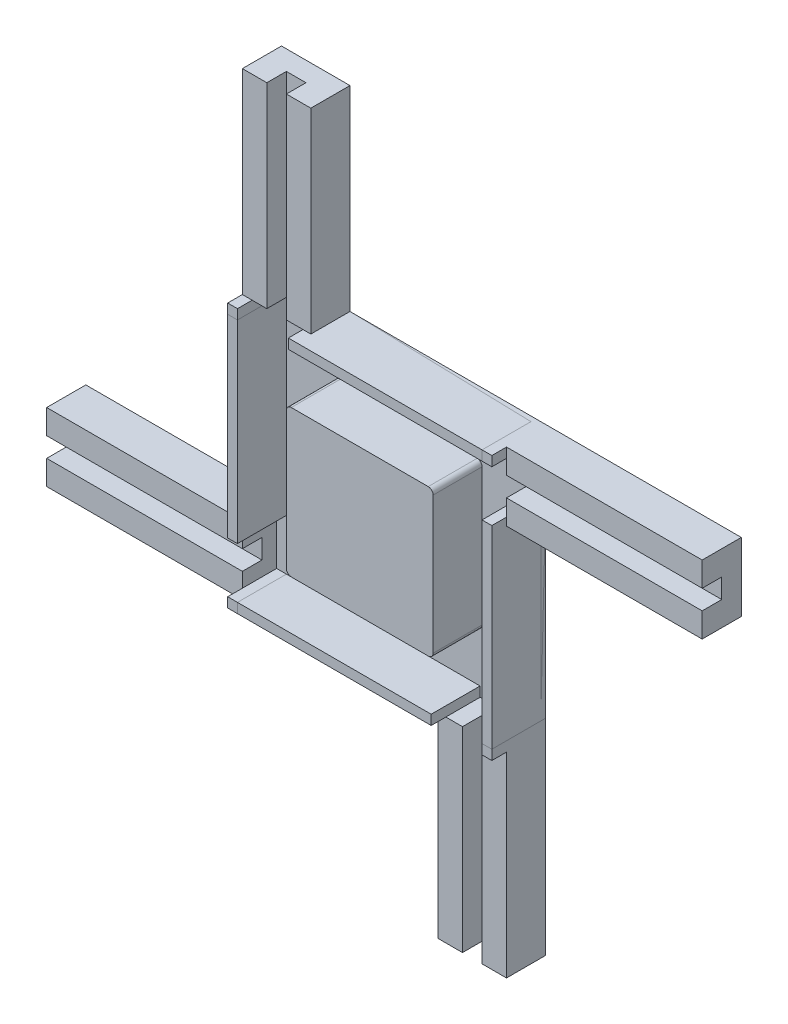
ISO-10303-21;
HEADER;
FILE_DESCRIPTION(('STEP AP214'),'2;1');
FILE_NAME('part.step','',(''),(''),'','','');
FILE_SCHEMA(('AUTOMOTIVE_DESIGN { 1 0 10303 214 1 1 1 1 }'));
ENDSEC;
DATA;
#1=APPLICATION_CONTEXT('core data for automotive mechanical design processes');
#2=APPLICATION_PROTOCOL_DEFINITION('international standard','automotive_design',2000,#1);
#3=PRODUCT_CONTEXT('',#1,'mechanical');
#4=PRODUCT('Part','Part','',(#3));
#5=PRODUCT_RELATED_PRODUCT_CATEGORY('part','',(#4));
#6=PRODUCT_DEFINITION_FORMATION('','',#4);
#7=PRODUCT_DEFINITION_CONTEXT('part definition',#1,'design');
#8=PRODUCT_DEFINITION('design','',#6,#7);
#9=PRODUCT_DEFINITION_SHAPE('','',#8);
#10=(LENGTH_UNIT() NAMED_UNIT(*) SI_UNIT(.MILLI.,.METRE.));
#11=(NAMED_UNIT(*) PLANE_ANGLE_UNIT() SI_UNIT($,.RADIAN.));
#12=(NAMED_UNIT(*) SI_UNIT($,.STERADIAN.) SOLID_ANGLE_UNIT());
#13=UNCERTAINTY_MEASURE_WITH_UNIT(LENGTH_MEASURE(1.E-05),#10,'distance_accuracy_value','');
#14=(GEOMETRIC_REPRESENTATION_CONTEXT(3) GLOBAL_UNCERTAINTY_ASSIGNED_CONTEXT((#13)) GLOBAL_UNIT_ASSIGNED_CONTEXT((#10,
#11,#12)) REPRESENTATION_CONTEXT('',''));
#15=CARTESIAN_POINT('',(0.,0.,0.));
#16=DIRECTION('',(0.,0.,1.));
#17=DIRECTION('',(1.,0.,0.));
#18=AXIS2_PLACEMENT_3D('',#15,#16,#17);
#19=CARTESIAN_POINT('',(1.87927842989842E-12,275.141421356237,50.));
#20=DIRECTION('',(0.,0.,1.));
#21=DIRECTION('',(-1.,0.,0.));
#22=AXIS2_PLACEMENT_3D('',#19,#20,#21);
#23=PLANE('',#22);
#24=DIRECTION('',(0.,1.,0.));
#25=VECTOR('',#24,1.);
#26=CARTESIAN_POINT('',(-125.000000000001,-124.999999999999,50.));
#27=LINE('',#26,#25);
#28=CARTESIAN_POINT('',(-125.000000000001,-134.999999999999,50.));
#29=VERTEX_POINT('',#28);
#30=CARTESIAN_POINT('',(-125.000000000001,-124.999999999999,50.));
#31=VERTEX_POINT('',#30);
#32=EDGE_CURVE('E111',#29,#31,#27,.T.);
#33=ORIENTED_EDGE('',*,*,#32,.F.);
#34=DIRECTION('',(-1.,0.,0.));
#35=VECTOR('',#34,1.);
#36=CARTESIAN_POINT('',(-125.000000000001,-134.999999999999,50.));
#37=LINE('',#36,#35);
#38=CARTESIAN_POINT('',(72.9999999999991,-135.,50.));
#39=VERTEX_POINT('',#38);
#40=EDGE_CURVE('E134',#39,#29,#37,.T.);
#41=ORIENTED_EDGE('',*,*,#40,.F.);
#42=DIRECTION('',(0.,-1.,0.));
#43=VECTOR('',#42,1.);
#44=CARTESIAN_POINT('',(72.9999999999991,-125.,50.));
#45=LINE('',#44,#43);
#46=CARTESIAN_POINT('',(72.9999999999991,-125.,50.));
#47=VERTEX_POINT('',#46);
#48=EDGE_CURVE('E139',#47,#39,#45,.T.);
#49=ORIENTED_EDGE('',*,*,#48,.F.);
#50=DIRECTION('',(1.,0.,0.));
#51=VECTOR('',#50,1.);
#52=CARTESIAN_POINT('',(-125.000000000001,-124.999999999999,50.));
#53=LINE('',#52,#51);
#54=EDGE_CURVE('E154',#31,#47,#53,.T.);
#55=ORIENTED_EDGE('',*,*,#54,.F.);
#56=EDGE_LOOP('',(#33,#41,#49,#55));
#57=FACE_BOUND('',#56,.T.);
#58=ADVANCED_FACE('F103',(#57),#23,.T.);
#59=CARTESIAN_POINT('',(-125.000000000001,-134.999999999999,-5.));
#60=DIRECTION('',(0.,0.,1.));
#61=DIRECTION('',(-1.,0.,0.));
#62=AXIS2_PLACEMENT_3D('',#59,#60,#61);
#63=PLANE('',#62);
#64=DIRECTION('',(0.,1.,0.));
#65=VECTOR('',#64,1.);
#66=CARTESIAN_POINT('',(-125.000000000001,-124.999999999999,-5.));
#67=LINE('',#66,#65);
#68=CARTESIAN_POINT('',(-125.000000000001,-134.999999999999,-5.));
#69=VERTEX_POINT('',#68);
#70=CARTESIAN_POINT('',(-125.000000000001,-124.999999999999,-5.));
#71=VERTEX_POINT('',#70);
#72=EDGE_CURVE('E163',#69,#71,#67,.T.);
#73=ORIENTED_EDGE('',*,*,#72,.T.);
#74=DIRECTION('',(1.,0.,0.));
#75=VECTOR('',#74,1.);
#76=CARTESIAN_POINT('',(-125.000000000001,-124.999999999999,-5.));
#77=LINE('',#76,#75);
#78=CARTESIAN_POINT('',(72.9999999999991,-125.,-5.));
#79=VERTEX_POINT('',#78);
#80=EDGE_CURVE('E152',#71,#79,#77,.T.);
#81=ORIENTED_EDGE('',*,*,#80,.T.);
#82=DIRECTION('',(0.,-1.,0.));
#83=VECTOR('',#82,1.);
#84=CARTESIAN_POINT('',(72.9999999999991,-125.,-5.));
#85=LINE('',#84,#83);
#86=CARTESIAN_POINT('',(72.9999999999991,-135.,-5.));
#87=VERTEX_POINT('',#86);
#88=EDGE_CURVE('E155',#79,#87,#85,.T.);
#89=ORIENTED_EDGE('',*,*,#88,.T.);
#90=DIRECTION('',(-1.,0.,0.));
#91=VECTOR('',#90,1.);
#92=CARTESIAN_POINT('',(-125.000000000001,-134.999999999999,-5.));
#93=LINE('',#92,#91);
#94=EDGE_CURVE('E160',#87,#69,#93,.T.);
#95=ORIENTED_EDGE('',*,*,#94,.T.);
#96=EDGE_LOOP('',(#73,#81,#89,#95));
#97=FACE_BOUND('',#96,.T.);
#98=ADVANCED_FACE('F162',(#97),#63,.F.);
#99=CARTESIAN_POINT('',(-125.000000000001,-124.999999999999,248.25236442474));
#100=DIRECTION('',(0.,1.,0.));
#101=DIRECTION('',(0.,0.,-1.));
#102=AXIS2_PLACEMENT_3D('',#99,#100,#101);
#103=PLANE('',#102);
#104=DIRECTION('',(0.,0.,-1.));
#105=VECTOR('',#104,1.);
#106=CARTESIAN_POINT('',(-125.000000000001,-124.999999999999,248.25236442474));
#107=LINE('',#106,#105);
#108=EDGE_CURVE('E13',#31,#71,#107,.T.);
#109=ORIENTED_EDGE('',*,*,#108,.F.);
#110=ORIENTED_EDGE('',*,*,#54,.T.);
#111=DIRECTION('',(0.,0.,-1.));
#112=VECTOR('',#111,1.);
#113=CARTESIAN_POINT('',(72.9999999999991,-125.,248.25236442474));
#114=LINE('',#113,#112);
#115=EDGE_CURVE('E149',#47,#79,#114,.T.);
#116=ORIENTED_EDGE('',*,*,#115,.T.);
#117=ORIENTED_EDGE('',*,*,#80,.F.);
#118=EDGE_LOOP('',(#109,#110,#116,#117));
#119=FACE_BOUND('',#118,.T.);
#120=ADVANCED_FACE('F150',(#119),#103,.T.);
#121=CARTESIAN_POINT('',(72.9999999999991,-125.,248.25236442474));
#122=DIRECTION('',(1.,0.,0.));
#123=DIRECTION('',(0.,0.,1.));
#124=AXIS2_PLACEMENT_3D('',#121,#122,#123);
#125=PLANE('',#124);
#126=ORIENTED_EDGE('',*,*,#115,.F.);
#127=ORIENTED_EDGE('',*,*,#48,.T.);
#128=DIRECTION('',(0.,0.,-1.));
#129=VECTOR('',#128,1.);
#130=CARTESIAN_POINT('',(72.9999999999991,-135.,248.25236442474));
#131=LINE('',#130,#129);
#132=EDGE_CURVE('E144',#39,#87,#131,.T.);
#133=ORIENTED_EDGE('',*,*,#132,.T.);
#134=ORIENTED_EDGE('',*,*,#88,.F.);
#135=EDGE_LOOP('',(#126,#127,#133,#134));
#136=FACE_BOUND('',#135,.T.);
#137=ADVANCED_FACE('F156',(#136),#125,.T.);
#138=CARTESIAN_POINT('',(-125.000000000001,-134.999999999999,248.25236442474));
#139=DIRECTION('',(0.,-1.,0.));
#140=DIRECTION('',(0.,0.,1.));
#141=AXIS2_PLACEMENT_3D('',#138,#139,#140);
#142=PLANE('',#141);
#143=ORIENTED_EDGE('',*,*,#132,.F.);
#144=ORIENTED_EDGE('',*,*,#40,.T.);
#145=DIRECTION('',(0.,0.,-1.));
#146=VECTOR('',#145,1.);
#147=CARTESIAN_POINT('',(-125.000000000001,-134.999999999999,248.25236442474));
#148=LINE('',#147,#146);
#149=EDGE_CURVE('E170',#29,#69,#148,.T.);
#150=ORIENTED_EDGE('',*,*,#149,.T.);
#151=ORIENTED_EDGE('',*,*,#94,.F.);
#152=EDGE_LOOP('',(#143,#144,#150,#151));
#153=FACE_BOUND('',#152,.T.);
#154=ADVANCED_FACE('F176',(#153),#142,.T.);
#155=CARTESIAN_POINT('',(-125.000000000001,-124.999999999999,248.25236442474));
#156=DIRECTION('',(-1.,0.,0.));
#157=DIRECTION('',(0.,0.,-1.));
#158=AXIS2_PLACEMENT_3D('',#155,#156,#157);
#159=PLANE('',#158);
#160=ORIENTED_EDGE('',*,*,#149,.F.);
#161=ORIENTED_EDGE('',*,*,#32,.T.);
#162=ORIENTED_EDGE('',*,*,#108,.T.);
#163=ORIENTED_EDGE('',*,*,#72,.F.);
#164=EDGE_LOOP('',(#160,#161,#162,#163));
#165=FACE_BOUND('',#164,.T.);
#166=ADVANCED_FACE('F177',(#165),#159,.T.);
#167=CLOSED_SHELL('',(#58,#98,#120,#137,#154,#166));
#168=MANIFOLD_SOLID_BREP('B2',#167);
#169=CARTESIAN_POINT('',(0.,-275.141421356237,50.));
#170=DIRECTION('',(0.,0.,1.));
#171=DIRECTION('',(1.,0.,0.));
#172=AXIS2_PLACEMENT_3D('',#169,#170,#171);
#173=PLANE('',#172);
#174=DIRECTION('',(0.,-1.,0.));
#175=VECTOR('',#174,1.);
#176=CARTESIAN_POINT('',(125.,125.,50.));
#177=LINE('',#176,#175);
#178=CARTESIAN_POINT('',(125.,135.,50.));
#179=VERTEX_POINT('',#178);
#180=CARTESIAN_POINT('',(125.,125.,50.));
#181=VERTEX_POINT('',#180);
#182=EDGE_CURVE('E244',#179,#181,#177,.T.);
#183=ORIENTED_EDGE('',*,*,#182,.F.);
#184=DIRECTION('',(1.,0.,0.));
#185=VECTOR('',#184,1.);
#186=CARTESIAN_POINT('',(125.,135.,50.));
#187=LINE('',#186,#185);
#188=CARTESIAN_POINT('',(-73.,135.,50.));
#189=VERTEX_POINT('',#188);
#190=EDGE_CURVE('E267',#189,#179,#187,.T.);
#191=ORIENTED_EDGE('',*,*,#190,.F.);
#192=DIRECTION('',(0.,1.,0.));
#193=VECTOR('',#192,1.);
#194=CARTESIAN_POINT('',(-73.,125.,50.));
#195=LINE('',#194,#193);
#196=CARTESIAN_POINT('',(-73.,125.,50.));
#197=VERTEX_POINT('',#196);
#198=EDGE_CURVE('E272',#197,#189,#195,.T.);
#199=ORIENTED_EDGE('',*,*,#198,.F.);
#200=DIRECTION('',(-1.,0.,0.));
#201=VECTOR('',#200,1.);
#202=CARTESIAN_POINT('',(125.,125.,50.));
#203=LINE('',#202,#201);
#204=EDGE_CURVE('E287',#181,#197,#203,.T.);
#205=ORIENTED_EDGE('',*,*,#204,.F.);
#206=EDGE_LOOP('',(#183,#191,#199,#205));
#207=FACE_BOUND('',#206,.T.);
#208=ADVANCED_FACE('F236',(#207),#173,.T.);
#209=CARTESIAN_POINT('',(125.,135.,-5.));
#210=DIRECTION('',(0.,0.,1.));
#211=DIRECTION('',(1.,0.,0.));
#212=AXIS2_PLACEMENT_3D('',#209,#210,#211);
#213=PLANE('',#212);
#214=DIRECTION('',(0.,-1.,0.));
#215=VECTOR('',#214,1.);
#216=CARTESIAN_POINT('',(125.,125.,-5.));
#217=LINE('',#216,#215);
#218=CARTESIAN_POINT('',(125.,135.,-5.));
#219=VERTEX_POINT('',#218);
#220=CARTESIAN_POINT('',(125.,125.,-5.));
#221=VERTEX_POINT('',#220);
#222=EDGE_CURVE('E296',#219,#221,#217,.T.);
#223=ORIENTED_EDGE('',*,*,#222,.T.);
#224=DIRECTION('',(-1.,0.,0.));
#225=VECTOR('',#224,1.);
#226=CARTESIAN_POINT('',(125.,125.,-5.));
#227=LINE('',#226,#225);
#228=CARTESIAN_POINT('',(-73.,125.,-5.));
#229=VERTEX_POINT('',#228);
#230=EDGE_CURVE('E285',#221,#229,#227,.T.);
#231=ORIENTED_EDGE('',*,*,#230,.T.);
#232=DIRECTION('',(0.,1.,0.));
#233=VECTOR('',#232,1.);
#234=CARTESIAN_POINT('',(-73.,125.,-5.));
#235=LINE('',#234,#233);
#236=CARTESIAN_POINT('',(-73.,135.,-5.));
#237=VERTEX_POINT('',#236);
#238=EDGE_CURVE('E288',#229,#237,#235,.T.);
#239=ORIENTED_EDGE('',*,*,#238,.T.);
#240=DIRECTION('',(1.,0.,0.));
#241=VECTOR('',#240,1.);
#242=CARTESIAN_POINT('',(125.,135.,-5.));
#243=LINE('',#242,#241);
#244=EDGE_CURVE('E293',#237,#219,#243,.T.);
#245=ORIENTED_EDGE('',*,*,#244,.T.);
#246=EDGE_LOOP('',(#223,#231,#239,#245));
#247=FACE_BOUND('',#246,.T.);
#248=ADVANCED_FACE('F295',(#247),#213,.F.);
#249=CARTESIAN_POINT('',(125.,125.,248.25236442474));
#250=DIRECTION('',(0.,-1.,0.));
#251=DIRECTION('',(0.,0.,-1.));
#252=AXIS2_PLACEMENT_3D('',#249,#250,#251);
#253=PLANE('',#252);
#254=DIRECTION('',(0.,0.,-1.));
#255=VECTOR('',#254,1.);
#256=CARTESIAN_POINT('',(125.,125.,248.25236442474));
#257=LINE('',#256,#255);
#258=EDGE_CURVE('E101',#181,#221,#257,.T.);
#259=ORIENTED_EDGE('',*,*,#258,.F.);
#260=ORIENTED_EDGE('',*,*,#204,.T.);
#261=DIRECTION('',(0.,0.,-1.));
#262=VECTOR('',#261,1.);
#263=CARTESIAN_POINT('',(-73.,125.,248.25236442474));
#264=LINE('',#263,#262);
#265=EDGE_CURVE('E282',#197,#229,#264,.T.);
#266=ORIENTED_EDGE('',*,*,#265,.T.);
#267=ORIENTED_EDGE('',*,*,#230,.F.);
#268=EDGE_LOOP('',(#259,#260,#266,#267));
#269=FACE_BOUND('',#268,.T.);
#270=ADVANCED_FACE('F283',(#269),#253,.T.);
#271=CARTESIAN_POINT('',(-73.,125.,248.25236442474));
#272=DIRECTION('',(-1.,0.,0.));
#273=DIRECTION('',(0.,0.,1.));
#274=AXIS2_PLACEMENT_3D('',#271,#272,#273);
#275=PLANE('',#274);
#276=ORIENTED_EDGE('',*,*,#265,.F.);
#277=ORIENTED_EDGE('',*,*,#198,.T.);
#278=DIRECTION('',(0.,0.,-1.));
#279=VECTOR('',#278,1.);
#280=CARTESIAN_POINT('',(-73.,135.,248.25236442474));
#281=LINE('',#280,#279);
#282=EDGE_CURVE('E277',#189,#237,#281,.T.);
#283=ORIENTED_EDGE('',*,*,#282,.T.);
#284=ORIENTED_EDGE('',*,*,#238,.F.);
#285=EDGE_LOOP('',(#276,#277,#283,#284));
#286=FACE_BOUND('',#285,.T.);
#287=ADVANCED_FACE('F289',(#286),#275,.T.);
#288=CARTESIAN_POINT('',(125.,135.,248.25236442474));
#289=DIRECTION('',(0.,1.,0.));
#290=DIRECTION('',(0.,0.,1.));
#291=AXIS2_PLACEMENT_3D('',#288,#289,#290);
#292=PLANE('',#291);
#293=ORIENTED_EDGE('',*,*,#282,.F.);
#294=ORIENTED_EDGE('',*,*,#190,.T.);
#295=DIRECTION('',(0.,0.,-1.));
#296=VECTOR('',#295,1.);
#297=CARTESIAN_POINT('',(125.,135.,248.25236442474));
#298=LINE('',#297,#296);
#299=EDGE_CURVE('E303',#179,#219,#298,.T.);
#300=ORIENTED_EDGE('',*,*,#299,.T.);
#301=ORIENTED_EDGE('',*,*,#244,.F.);
#302=EDGE_LOOP('',(#293,#294,#300,#301));
#303=FACE_BOUND('',#302,.T.);
#304=ADVANCED_FACE('F309',(#303),#292,.T.);
#305=CARTESIAN_POINT('',(125.,125.,248.25236442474));
#306=DIRECTION('',(1.,0.,0.));
#307=DIRECTION('',(0.,0.,-1.));
#308=AXIS2_PLACEMENT_3D('',#305,#306,#307);
#309=PLANE('',#308);
#310=ORIENTED_EDGE('',*,*,#299,.F.);
#311=ORIENTED_EDGE('',*,*,#182,.T.);
#312=ORIENTED_EDGE('',*,*,#258,.T.);
#313=ORIENTED_EDGE('',*,*,#222,.F.);
#314=EDGE_LOOP('',(#310,#311,#312,#313));
#315=FACE_BOUND('',#314,.T.);
#316=ADVANCED_FACE('F310',(#315),#309,.T.);
#317=CLOSED_SHELL('',(#208,#248,#270,#287,#304,#316));
#318=MANIFOLD_SOLID_BREP('B7',#317);
#319=CARTESIAN_POINT('',(275.141421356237,-2.83993012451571E-12,50.));
#320=DIRECTION('',(0.,0.,1.));
#321=DIRECTION('',(0.,1.,0.));
#322=AXIS2_PLACEMENT_3D('',#319,#320,#321);
#323=PLANE('',#322);
#324=DIRECTION('',(1.,0.,0.));
#325=VECTOR('',#324,1.);
#326=CARTESIAN_POINT('',(-124.999999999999,125.000000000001,50.));
#327=LINE('',#326,#325);
#328=CARTESIAN_POINT('',(-134.999999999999,125.000000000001,50.));
#329=VERTEX_POINT('',#328);
#330=CARTESIAN_POINT('',(-124.999999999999,125.000000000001,50.));
#331=VERTEX_POINT('',#330);
#332=EDGE_CURVE('E377',#329,#331,#327,.T.);
#333=ORIENTED_EDGE('',*,*,#332,.F.);
#334=DIRECTION('',(0.,1.,0.));
#335=VECTOR('',#334,1.);
#336=CARTESIAN_POINT('',(-134.999999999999,125.000000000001,50.));
#337=LINE('',#336,#335);
#338=CARTESIAN_POINT('',(-135.000000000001,-72.9999999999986,50.));
#339=VERTEX_POINT('',#338);
#340=EDGE_CURVE('E400',#339,#329,#337,.T.);
#341=ORIENTED_EDGE('',*,*,#340,.F.);
#342=DIRECTION('',(-1.,0.,0.));
#343=VECTOR('',#342,1.);
#344=CARTESIAN_POINT('',(-125.000000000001,-72.9999999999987,50.));
#345=LINE('',#344,#343);
#346=CARTESIAN_POINT('',(-125.000000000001,-72.9999999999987,50.));
#347=VERTEX_POINT('',#346);
#348=EDGE_CURVE('E405',#347,#339,#345,.T.);
#349=ORIENTED_EDGE('',*,*,#348,.F.);
#350=DIRECTION('',(0.,-1.,0.));
#351=VECTOR('',#350,1.);
#352=CARTESIAN_POINT('',(-124.999999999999,125.000000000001,50.));
#353=LINE('',#352,#351);
#354=EDGE_CURVE('E420',#331,#347,#353,.T.);
#355=ORIENTED_EDGE('',*,*,#354,.F.);
#356=EDGE_LOOP('',(#333,#341,#349,#355));
#357=FACE_BOUND('',#356,.T.);
#358=ADVANCED_FACE('F369',(#357),#323,.T.);
#359=CARTESIAN_POINT('',(-134.999999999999,125.000000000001,-5.));
#360=DIRECTION('',(0.,0.,1.));
#361=DIRECTION('',(0.,1.,0.));
#362=AXIS2_PLACEMENT_3D('',#359,#360,#361);
#363=PLANE('',#362);
#364=DIRECTION('',(1.,0.,0.));
#365=VECTOR('',#364,1.);
#366=CARTESIAN_POINT('',(-124.999999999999,125.000000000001,-5.));
#367=LINE('',#366,#365);
#368=CARTESIAN_POINT('',(-134.999999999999,125.000000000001,-5.));
#369=VERTEX_POINT('',#368);
#370=CARTESIAN_POINT('',(-124.999999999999,125.000000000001,-5.));
#371=VERTEX_POINT('',#370);
#372=EDGE_CURVE('E429',#369,#371,#367,.T.);
#373=ORIENTED_EDGE('',*,*,#372,.T.);
#374=DIRECTION('',(0.,-1.,0.));
#375=VECTOR('',#374,1.);
#376=CARTESIAN_POINT('',(-124.999999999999,125.000000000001,-5.));
#377=LINE('',#376,#375);
#378=CARTESIAN_POINT('',(-125.000000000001,-72.9999999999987,-5.));
#379=VERTEX_POINT('',#378);
#380=EDGE_CURVE('E418',#371,#379,#377,.T.);
#381=ORIENTED_EDGE('',*,*,#380,.T.);
#382=DIRECTION('',(-1.,0.,0.));
#383=VECTOR('',#382,1.);
#384=CARTESIAN_POINT('',(-125.000000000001,-72.9999999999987,-5.));
#385=LINE('',#384,#383);
#386=CARTESIAN_POINT('',(-135.000000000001,-72.9999999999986,-5.));
#387=VERTEX_POINT('',#386);
#388=EDGE_CURVE('E421',#379,#387,#385,.T.);
#389=ORIENTED_EDGE('',*,*,#388,.T.);
#390=DIRECTION('',(0.,1.,0.));
#391=VECTOR('',#390,1.);
#392=CARTESIAN_POINT('',(-134.999999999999,125.000000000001,-5.));
#393=LINE('',#392,#391);
#394=EDGE_CURVE('E426',#387,#369,#393,.T.);
#395=ORIENTED_EDGE('',*,*,#394,.T.);
#396=EDGE_LOOP('',(#373,#381,#389,#395));
#397=FACE_BOUND('',#396,.T.);
#398=ADVANCED_FACE('F428',(#397),#363,.F.);
#399=CARTESIAN_POINT('',(-124.999999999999,125.000000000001,248.25236442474));
#400=DIRECTION('',(1.,0.,0.));
#401=DIRECTION('',(0.,0.,-1.));
#402=AXIS2_PLACEMENT_3D('',#399,#400,#401);
#403=PLANE('',#402);
#404=DIRECTION('',(0.,0.,-1.));
#405=VECTOR('',#404,1.);
#406=CARTESIAN_POINT('',(-124.999999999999,125.000000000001,248.25236442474));
#407=LINE('',#406,#405);
#408=EDGE_CURVE('E234',#331,#371,#407,.T.);
#409=ORIENTED_EDGE('',*,*,#408,.F.);
#410=ORIENTED_EDGE('',*,*,#354,.T.);
#411=DIRECTION('',(0.,0.,-1.));
#412=VECTOR('',#411,1.);
#413=CARTESIAN_POINT('',(-125.000000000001,-72.9999999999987,248.25236442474));
#414=LINE('',#413,#412);
#415=EDGE_CURVE('E415',#347,#379,#414,.T.);
#416=ORIENTED_EDGE('',*,*,#415,.T.);
#417=ORIENTED_EDGE('',*,*,#380,.F.);
#418=EDGE_LOOP('',(#409,#410,#416,#417));
#419=FACE_BOUND('',#418,.T.);
#420=ADVANCED_FACE('F416',(#419),#403,.T.);
#421=CARTESIAN_POINT('',(-125.000000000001,-72.9999999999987,248.25236442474));
#422=DIRECTION('',(0.,-1.,0.));
#423=DIRECTION('',(0.,0.,1.));
#424=AXIS2_PLACEMENT_3D('',#421,#422,#423);
#425=PLANE('',#424);
#426=ORIENTED_EDGE('',*,*,#415,.F.);
#427=ORIENTED_EDGE('',*,*,#348,.T.);
#428=DIRECTION('',(0.,0.,-1.));
#429=VECTOR('',#428,1.);
#430=CARTESIAN_POINT('',(-135.000000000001,-72.9999999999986,248.25236442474));
#431=LINE('',#430,#429);
#432=EDGE_CURVE('E410',#339,#387,#431,.T.);
#433=ORIENTED_EDGE('',*,*,#432,.T.);
#434=ORIENTED_EDGE('',*,*,#388,.F.);
#435=EDGE_LOOP('',(#426,#427,#433,#434));
#436=FACE_BOUND('',#435,.T.);
#437=ADVANCED_FACE('F422',(#436),#425,.T.);
#438=CARTESIAN_POINT('',(-134.999999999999,125.000000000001,248.25236442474));
#439=DIRECTION('',(-1.,0.,0.));
#440=DIRECTION('',(0.,0.,1.));
#441=AXIS2_PLACEMENT_3D('',#438,#439,#440);
#442=PLANE('',#441);
#443=ORIENTED_EDGE('',*,*,#432,.F.);
#444=ORIENTED_EDGE('',*,*,#340,.T.);
#445=DIRECTION('',(0.,0.,-1.));
#446=VECTOR('',#445,1.);
#447=CARTESIAN_POINT('',(-134.999999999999,125.000000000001,248.25236442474));
#448=LINE('',#447,#446);
#449=EDGE_CURVE('E436',#329,#369,#448,.T.);
#450=ORIENTED_EDGE('',*,*,#449,.T.);
#451=ORIENTED_EDGE('',*,*,#394,.F.);
#452=EDGE_LOOP('',(#443,#444,#450,#451));
#453=FACE_BOUND('',#452,.T.);
#454=ADVANCED_FACE('F442',(#453),#442,.T.);
#455=CARTESIAN_POINT('',(-124.999999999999,125.000000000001,248.25236442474));
#456=DIRECTION('',(0.,1.,0.));
#457=DIRECTION('',(0.,0.,-1.));
#458=AXIS2_PLACEMENT_3D('',#455,#456,#457);
#459=PLANE('',#458);
#460=ORIENTED_EDGE('',*,*,#449,.F.);
#461=ORIENTED_EDGE('',*,*,#332,.T.);
#462=ORIENTED_EDGE('',*,*,#408,.T.);
#463=ORIENTED_EDGE('',*,*,#372,.F.);
#464=EDGE_LOOP('',(#460,#461,#462,#463));
#465=FACE_BOUND('',#464,.T.);
#466=ADVANCED_FACE('F443',(#465),#459,.T.);
#467=CLOSED_SHELL('',(#358,#398,#420,#437,#454,#466));
#468=MANIFOLD_SOLID_BREP('B95',#467);
#469=CARTESIAN_POINT('',(-234.133109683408,135.000000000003,0.707352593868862));
#470=DIRECTION('',(0.,1.,0.));
#471=DIRECTION('',(-1.,0.,0.));
#472=AXIS2_PLACEMENT_3D('',#469,#470,#471);
#473=PLANE('',#472);
#474=DIRECTION('',(-1.,0.,0.));
#475=VECTOR('',#474,1.);
#476=CARTESIAN_POINT('',(-234.133109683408,135.000000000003,35.));
#477=LINE('',#476,#475);
#478=CARTESIAN_POINT('',(-109.999999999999,135.000000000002,35.));
#479=VERTEX_POINT('',#478);
#480=CARTESIAN_POINT('',(-124.999999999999,135.000000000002,35.));
#481=VERTEX_POINT('',#480);
#482=EDGE_CURVE('E609',#479,#481,#477,.T.);
#483=ORIENTED_EDGE('',*,*,#482,.T.);
#484=DIRECTION('',(0.,0.,-1.));
#485=VECTOR('',#484,1.);
#486=CARTESIAN_POINT('',(-124.999999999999,135.000000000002,50.));
#487=LINE('',#486,#485);
#488=CARTESIAN_POINT('',(-124.999999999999,135.000000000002,0.));
#489=VERTEX_POINT('',#488);
#490=EDGE_CURVE('E367',#481,#489,#487,.T.);
#491=ORIENTED_EDGE('',*,*,#490,.T.);
#492=DIRECTION('',(1.,0.,0.));
#493=VECTOR('',#492,1.);
#494=CARTESIAN_POINT('',(-125.,135.,0.));
#495=LINE('',#494,#493);
#496=CARTESIAN_POINT('',(-64.9999999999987,135.000000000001,0.));
#497=VERTEX_POINT('',#496);
#498=EDGE_CURVE('E1266',#489,#497,#495,.T.);
#499=ORIENTED_EDGE('',*,*,#498,.T.);
#500=DIRECTION('',(0.,0.,-1.));
#501=VECTOR('',#500,1.);
#502=CARTESIAN_POINT('',(-64.9999999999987,135.000000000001,0.707352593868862));
#503=LINE('',#502,#501);
#504=CARTESIAN_POINT('',(-64.9999999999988,135.000000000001,35.));
#505=VERTEX_POINT('',#504);
#506=EDGE_CURVE('E631',#505,#497,#503,.T.);
#507=ORIENTED_EDGE('',*,*,#506,.F.);
#508=DIRECTION('',(1.,0.,0.));
#509=VECTOR('',#508,1.);
#510=CARTESIAN_POINT('',(-234.133109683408,135.000000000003,35.));
#511=LINE('',#510,#509);
#512=CARTESIAN_POINT('',(-89.9999999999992,135.000000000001,35.));
#513=VERTEX_POINT('',#512);
#514=EDGE_CURVE('E632',#513,#505,#511,.T.);
#515=ORIENTED_EDGE('',*,*,#514,.F.);
#516=DIRECTION('',(0.,0.,-1.));
#517=VECTOR('',#516,1.);
#518=CARTESIAN_POINT('',(-89.9999999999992,135.000000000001,0.707352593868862));
#519=LINE('',#518,#517);
#520=CARTESIAN_POINT('',(-89.9999999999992,135.000000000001,15.));
#521=VERTEX_POINT('',#520);
#522=EDGE_CURVE('E2362',#513,#521,#519,.T.);
#523=ORIENTED_EDGE('',*,*,#522,.T.);
#524=DIRECTION('',(-1.,0.,0.));
#525=VECTOR('',#524,1.);
#526=CARTESIAN_POINT('',(-234.133109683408,135.000000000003,15.));
#527=LINE('',#526,#525);
#528=CARTESIAN_POINT('',(-109.999999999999,135.000000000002,15.));
#529=VERTEX_POINT('',#528);
#530=EDGE_CURVE('E587',#521,#529,#527,.T.);
#531=ORIENTED_EDGE('',*,*,#530,.T.);
#532=DIRECTION('',(0.,0.,-1.));
#533=VECTOR('',#532,1.);
#534=CARTESIAN_POINT('',(-109.999999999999,135.000000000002,0.707352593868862));
#535=LINE('',#534,#533);
#536=EDGE_CURVE('E613',#479,#529,#535,.T.);
#537=ORIENTED_EDGE('',*,*,#536,.F.);
#538=EDGE_LOOP('',(#483,#491,#499,#507,#515,#523,#531,#537));
#539=FACE_BOUND('',#538,.T.);
#540=ADVANCED_FACE('F501',(#539),#473,.F.);
#541=CARTESIAN_POINT('',(-234.133109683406,335.000000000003,-4.99999999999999));
#542=DIRECTION('',(0.,0.,1.));
#543=DIRECTION('',(-1.,0.,0.));
#544=AXIS2_PLACEMENT_3D('',#541,#542,#543);
#545=PLANE('',#544);
#546=DIRECTION('',(0.,-1.,0.));
#547=VECTOR('',#546,1.);
#548=CARTESIAN_POINT('',(-64.999999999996,335.000000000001,-5.));
#549=LINE('',#548,#547);
#550=CARTESIAN_POINT('',(-64.999999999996,335.000000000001,-5.));
#551=VERTEX_POINT('',#550);
#552=CARTESIAN_POINT('',(-64.9999999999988,135.000000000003,-4.99999999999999));
#553=VERTEX_POINT('',#552);
#554=EDGE_CURVE('E619',#551,#553,#549,.T.);
#555=ORIENTED_EDGE('',*,*,#554,.T.);
#556=DIRECTION('',(-1.,0.,0.));
#557=VECTOR('',#556,1.);
#558=CARTESIAN_POINT('',(335.000000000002,134.999999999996,-4.99999999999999));
#559=LINE('',#558,#557);
#560=CARTESIAN_POINT('',(335.000000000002,134.999999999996,-4.99999999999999));
#561=VERTEX_POINT('',#560);
#562=EDGE_CURVE('E676',#561,#553,#559,.T.);
#563=ORIENTED_EDGE('',*,*,#562,.F.);
#564=DIRECTION('',(0.,1.,0.));
#565=VECTOR('',#564,1.);
#566=CARTESIAN_POINT('',(335.000000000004,234.133109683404,-4.99999999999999));
#567=LINE('',#566,#565);
#568=CARTESIAN_POINT('',(335.000000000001,64.9999999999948,-5.));
#569=VERTEX_POINT('',#568);
#570=EDGE_CURVE('E1136',#569,#561,#567,.T.);
#571=ORIENTED_EDGE('',*,*,#570,.F.);
#572=DIRECTION('',(-1.,0.,0.));
#573=VECTOR('',#572,1.);
#574=CARTESIAN_POINT('',(335.000000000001,64.9999999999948,-5.));
#575=LINE('',#574,#573);
#576=CARTESIAN_POINT('',(135.000000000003,64.9999999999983,-4.99999999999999));
#577=VERTEX_POINT('',#576);
#578=EDGE_CURVE('E1164',#569,#577,#575,.T.);
#579=ORIENTED_EDGE('',*,*,#578,.T.);
#580=DIRECTION('',(0.,1.,0.));
#581=VECTOR('',#580,1.);
#582=CARTESIAN_POINT('',(134.999999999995,-335.000000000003,-4.99999999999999));
#583=LINE('',#582,#581);
#584=CARTESIAN_POINT('',(134.999999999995,-335.000000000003,-4.99999999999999));
#585=VERTEX_POINT('',#584);
#586=EDGE_CURVE('E1133',#585,#577,#583,.T.);
#587=ORIENTED_EDGE('',*,*,#586,.F.);
#588=DIRECTION('',(1.,0.,0.));
#589=VECTOR('',#588,1.);
#590=CARTESIAN_POINT('',(234.133109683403,-335.000000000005,-4.99999999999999));
#591=LINE('',#590,#589);
#592=CARTESIAN_POINT('',(64.9999999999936,-335.000000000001,-5.));
#593=VERTEX_POINT('',#592);
#594=EDGE_CURVE('E853',#593,#585,#591,.T.);
#595=ORIENTED_EDGE('',*,*,#594,.F.);
#596=DIRECTION('',(0.,1.,0.));
#597=VECTOR('',#596,1.);
#598=CARTESIAN_POINT('',(64.9999999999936,-335.000000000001,-5.));
#599=LINE('',#598,#597);
#600=CARTESIAN_POINT('',(64.9999999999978,-135.000000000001,-5.));
#601=VERTEX_POINT('',#600);
#602=EDGE_CURVE('E1271',#593,#601,#599,.T.);
#603=ORIENTED_EDGE('',*,*,#602,.T.);
#604=DIRECTION('',(1.,0.,0.));
#605=VECTOR('',#604,1.);
#606=CARTESIAN_POINT('',(-125.000000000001,-134.999999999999,-5.));
#607=LINE('',#606,#605);
#608=CARTESIAN_POINT('',(-335.000000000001,-134.999999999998,-4.99999999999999));
#609=VERTEX_POINT('',#608);
#610=EDGE_CURVE('E838',#609,#601,#607,.T.);
#611=ORIENTED_EDGE('',*,*,#610,.F.);
#612=DIRECTION('',(0.,-1.,0.));
#613=VECTOR('',#612,1.);
#614=CARTESIAN_POINT('',(-335.000000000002,-234.133109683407,-4.99999999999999));
#615=LINE('',#614,#613);
#616=CARTESIAN_POINT('',(-335.000000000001,-64.9999999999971,-5.));
#617=VERTEX_POINT('',#616);
#618=EDGE_CURVE('E813',#617,#609,#615,.T.);
#619=ORIENTED_EDGE('',*,*,#618,.F.);
#620=DIRECTION('',(1.,0.,0.));
#621=VECTOR('',#620,1.);
#622=CARTESIAN_POINT('',(-335.000000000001,-64.9999999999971,-5.));
#623=LINE('',#622,#621);
#624=CARTESIAN_POINT('',(-135.,-64.9999999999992,-5.));
#625=VERTEX_POINT('',#624);
#626=EDGE_CURVE('E828',#617,#625,#623,.T.);
#627=ORIENTED_EDGE('',*,*,#626,.T.);
#628=DIRECTION('',(0.,-1.,0.));
#629=VECTOR('',#628,1.);
#630=CARTESIAN_POINT('',(-134.999999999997,335.000000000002,-4.99999999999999));
#631=LINE('',#630,#629);
#632=CARTESIAN_POINT('',(-134.999999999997,335.000000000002,-4.99999999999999));
#633=VERTEX_POINT('',#632);
#634=EDGE_CURVE('E510',#633,#625,#631,.T.);
#635=ORIENTED_EDGE('',*,*,#634,.F.);
#636=DIRECTION('',(-1.,0.,0.));
#637=VECTOR('',#636,1.);
#638=CARTESIAN_POINT('',(-234.133109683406,335.000000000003,-4.99999999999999));
#639=LINE('',#638,#637);
#640=EDGE_CURVE('E638',#551,#633,#639,.T.);
#641=ORIENTED_EDGE('',*,*,#640,.F.);
#642=EDGE_LOOP('',(#555,#563,#571,#579,#587,#595,#603,#611,#619,#627,#635,#641));
#643=FACE_BOUND('',#642,.T.);
#644=ADVANCED_FACE('F503',(#643),#545,.F.);
#645=CARTESIAN_POINT('',(-134.999999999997,335.000000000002,0.707352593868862));
#646=DIRECTION('',(1.,0.,0.));
#647=DIRECTION('',(0.,1.,0.));
#648=AXIS2_PLACEMENT_3D('',#645,#646,#647);
#649=PLANE('',#648);
#650=ORIENTED_EDGE('',*,*,#634,.T.);
#651=DIRECTION('',(0.,0.,-1.));
#652=VECTOR('',#651,1.);
#653=CARTESIAN_POINT('',(-135.000000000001,-64.9999999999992,0.707352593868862));
#654=LINE('',#653,#652);
#655=CARTESIAN_POINT('',(-135.,-64.9999999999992,0.));
#656=VERTEX_POINT('',#655);
#657=EDGE_CURVE('E808',#656,#625,#654,.T.);
#658=ORIENTED_EDGE('',*,*,#657,.F.);
#659=DIRECTION('',(0.,1.,0.));
#660=VECTOR('',#659,1.);
#661=CARTESIAN_POINT('',(-135.,-125.,0.));
#662=LINE('',#661,#660);
#663=CARTESIAN_POINT('',(-135.,125.,0.));
#664=VERTEX_POINT('',#663);
#665=EDGE_CURVE('E762',#656,#664,#662,.T.);
#666=ORIENTED_EDGE('',*,*,#665,.T.);
#667=DIRECTION('',(0.,0.,1.));
#668=VECTOR('',#667,1.);
#669=CARTESIAN_POINT('',(-134.999999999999,125.000000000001,-5.));
#670=LINE('',#669,#668);
#671=CARTESIAN_POINT('',(-134.999999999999,125.000000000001,50.));
#672=VERTEX_POINT('',#671);
#673=EDGE_CURVE('E688',#664,#672,#670,.T.);
#674=ORIENTED_EDGE('',*,*,#673,.T.);
#675=DIRECTION('',(0.,-1.,0.));
#676=VECTOR('',#675,1.);
#677=CARTESIAN_POINT('',(-134.999999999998,190.901699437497,50.));
#678=LINE('',#677,#676);
#679=CARTESIAN_POINT('',(-134.999999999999,135.000000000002,50.));
#680=VERTEX_POINT('',#679);
#681=EDGE_CURVE('E667',#680,#672,#678,.T.);
#682=ORIENTED_EDGE('',*,*,#681,.F.);
#683=DIRECTION('',(0.,0.,1.));
#684=VECTOR('',#683,1.);
#685=CARTESIAN_POINT('',(-134.999999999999,135.000000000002,-5.));
#686=LINE('',#685,#684);
#687=CARTESIAN_POINT('',(-134.999999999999,135.000000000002,35.));
#688=VERTEX_POINT('',#687);
#689=EDGE_CURVE('E659',#688,#680,#686,.T.);
#690=ORIENTED_EDGE('',*,*,#689,.F.);
#691=DIRECTION('',(0.,-1.,0.));
#692=VECTOR('',#691,1.);
#693=CARTESIAN_POINT('',(-134.999999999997,335.000000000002,35.));
#694=LINE('',#693,#692);
#695=CARTESIAN_POINT('',(-134.999999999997,335.000000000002,35.));
#696=VERTEX_POINT('',#695);
#697=EDGE_CURVE('E622',#696,#688,#694,.T.);
#698=ORIENTED_EDGE('',*,*,#697,.F.);
#699=DIRECTION('',(0.,0.,1.));
#700=VECTOR('',#699,1.);
#701=CARTESIAN_POINT('',(-134.999999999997,335.000000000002,0.707352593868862));
#702=LINE('',#701,#700);
#703=EDGE_CURVE('E2354',#633,#696,#702,.T.);
#704=ORIENTED_EDGE('',*,*,#703,.F.);
#705=EDGE_LOOP('',(#650,#658,#666,#674,#682,#690,#698,#704));
#706=FACE_BOUND('',#705,.T.);
#707=ADVANCED_FACE('F664',(#706),#649,.F.);
#708=CARTESIAN_POINT('',(-234.133109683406,335.000000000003,35.));
#709=DIRECTION('',(0.,0.,1.));
#710=DIRECTION('',(0.,-1.,0.));
#711=AXIS2_PLACEMENT_3D('',#708,#709,#710);
#712=PLANE('',#711);
#713=ORIENTED_EDGE('',*,*,#482,.F.);
#714=DIRECTION('',(0.,-1.,0.));
#715=VECTOR('',#714,1.);
#716=CARTESIAN_POINT('',(-109.999999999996,335.000000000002,35.));
#717=LINE('',#716,#715);
#718=CARTESIAN_POINT('',(-109.999999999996,335.000000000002,35.));
#719=VERTEX_POINT('',#718);
#720=EDGE_CURVE('E620',#719,#479,#717,.T.);
#721=ORIENTED_EDGE('',*,*,#720,.F.);
#722=DIRECTION('',(-1.,0.,0.));
#723=VECTOR('',#722,1.);
#724=CARTESIAN_POINT('',(-234.133109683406,335.000000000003,35.));
#725=LINE('',#724,#723);
#726=EDGE_CURVE('E2355',#719,#696,#725,.T.);
#727=ORIENTED_EDGE('',*,*,#726,.T.);
#728=ORIENTED_EDGE('',*,*,#697,.T.);
#729=EDGE_CURVE('E614',#481,#688,#477,.T.);
#730=ORIENTED_EDGE('',*,*,#729,.F.);
#731=EDGE_LOOP('',(#713,#721,#727,#728,#730));
#732=FACE_BOUND('',#731,.T.);
#733=ADVANCED_FACE('F651',(#732),#712,.T.);
#734=CARTESIAN_POINT('',(-109.999999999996,335.000000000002,0.707352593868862));
#735=DIRECTION('',(-1.,0.,0.));
#736=DIRECTION('',(0.,-1.,0.));
#737=AXIS2_PLACEMENT_3D('',#734,#735,#736);
#738=PLANE('',#737);
#739=ORIENTED_EDGE('',*,*,#536,.T.);
#740=DIRECTION('',(0.,-1.,0.));
#741=VECTOR('',#740,1.);
#742=CARTESIAN_POINT('',(-109.999999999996,335.000000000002,15.));
#743=LINE('',#742,#741);
#744=CARTESIAN_POINT('',(-109.999999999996,335.000000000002,15.));
#745=VERTEX_POINT('',#744);
#746=EDGE_CURVE('E592',#745,#529,#743,.T.);
#747=ORIENTED_EDGE('',*,*,#746,.F.);
#748=DIRECTION('',(0.,0.,-1.));
#749=VECTOR('',#748,1.);
#750=CARTESIAN_POINT('',(-109.999999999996,335.000000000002,0.707352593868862));
#751=LINE('',#750,#749);
#752=EDGE_CURVE('E599',#719,#745,#751,.T.);
#753=ORIENTED_EDGE('',*,*,#752,.F.);
#754=ORIENTED_EDGE('',*,*,#720,.T.);
#755=EDGE_LOOP('',(#739,#747,#753,#754));
#756=FACE_BOUND('',#755,.T.);
#757=ADVANCED_FACE('F645',(#756),#738,.F.);
#758=CARTESIAN_POINT('',(-234.133109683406,335.000000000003,15.));
#759=DIRECTION('',(0.,0.,1.));
#760=DIRECTION('',(-1.,0.,0.));
#761=AXIS2_PLACEMENT_3D('',#758,#759,#760);
#762=PLANE('',#761);
#763=ORIENTED_EDGE('',*,*,#530,.F.);
#764=DIRECTION('',(0.,-1.,0.));
#765=VECTOR('',#764,1.);
#766=CARTESIAN_POINT('',(-89.9999999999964,335.000000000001,15.));
#767=LINE('',#766,#765);
#768=CARTESIAN_POINT('',(-89.9999999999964,335.000000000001,15.));
#769=VERTEX_POINT('',#768);
#770=EDGE_CURVE('E582',#769,#521,#767,.T.);
#771=ORIENTED_EDGE('',*,*,#770,.F.);
#772=DIRECTION('',(-1.,0.,0.));
#773=VECTOR('',#772,1.);
#774=CARTESIAN_POINT('',(-234.133109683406,335.000000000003,15.));
#775=LINE('',#774,#773);
#776=EDGE_CURVE('E585',#769,#745,#775,.T.);
#777=ORIENTED_EDGE('',*,*,#776,.T.);
#778=ORIENTED_EDGE('',*,*,#746,.T.);
#779=EDGE_LOOP('',(#763,#771,#777,#778));
#780=FACE_BOUND('',#779,.T.);
#781=ADVANCED_FACE('F584',(#780),#762,.T.);
#782=CARTESIAN_POINT('',(-89.9999999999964,335.000000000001,0.707352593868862));
#783=DIRECTION('',(-1.,0.,0.));
#784=DIRECTION('',(0.,-1.,0.));
#785=AXIS2_PLACEMENT_3D('',#782,#783,#784);
#786=PLANE('',#785);
#787=ORIENTED_EDGE('',*,*,#522,.F.);
#788=DIRECTION('',(0.,-1.,0.));
#789=VECTOR('',#788,1.);
#790=CARTESIAN_POINT('',(-89.9999999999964,335.000000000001,35.));
#791=LINE('',#790,#789);
#792=CARTESIAN_POINT('',(-89.9999999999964,335.000000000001,35.));
#793=VERTEX_POINT('',#792);
#794=EDGE_CURVE('E593',#793,#513,#791,.T.);
#795=ORIENTED_EDGE('',*,*,#794,.F.);
#796=DIRECTION('',(0.,0.,-1.));
#797=VECTOR('',#796,1.);
#798=CARTESIAN_POINT('',(-89.9999999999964,335.000000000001,0.707352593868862));
#799=LINE('',#798,#797);
#800=EDGE_CURVE('E596',#793,#769,#799,.T.);
#801=ORIENTED_EDGE('',*,*,#800,.T.);
#802=ORIENTED_EDGE('',*,*,#770,.T.);
#803=EDGE_LOOP('',(#787,#795,#801,#802));
#804=FACE_BOUND('',#803,.T.);
#805=ADVANCED_FACE('F602',(#804),#786,.T.);
#806=CARTESIAN_POINT('',(-234.133109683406,335.000000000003,35.));
#807=DIRECTION('',(0.,0.,-1.));
#808=DIRECTION('',(0.,1.,0.));
#809=AXIS2_PLACEMENT_3D('',#806,#807,#808);
#810=PLANE('',#809);
#811=ORIENTED_EDGE('',*,*,#514,.T.);
#812=DIRECTION('',(0.,-1.,0.));
#813=VECTOR('',#812,1.);
#814=CARTESIAN_POINT('',(-64.999999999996,335.000000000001,35.));
#815=LINE('',#814,#813);
#816=CARTESIAN_POINT('',(-64.999999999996,335.000000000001,35.));
#817=VERTEX_POINT('',#816);
#818=EDGE_CURVE('E608',#817,#505,#815,.T.);
#819=ORIENTED_EDGE('',*,*,#818,.F.);
#820=DIRECTION('',(1.,0.,0.));
#821=VECTOR('',#820,1.);
#822=CARTESIAN_POINT('',(-234.133109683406,335.000000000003,35.));
#823=LINE('',#822,#821);
#824=EDGE_CURVE('E528',#793,#817,#823,.T.);
#825=ORIENTED_EDGE('',*,*,#824,.F.);
#826=ORIENTED_EDGE('',*,*,#794,.T.);
#827=EDGE_LOOP('',(#811,#819,#825,#826));
#828=FACE_BOUND('',#827,.T.);
#829=ADVANCED_FACE('F1402',(#828),#810,.F.);
#830=CARTESIAN_POINT('',(-64.999999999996,335.000000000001,0.707352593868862));
#831=DIRECTION('',(-1.,0.,0.));
#832=DIRECTION('',(0.,-1.,0.));
#833=AXIS2_PLACEMENT_3D('',#830,#831,#832);
#834=PLANE('',#833);
#835=ORIENTED_EDGE('',*,*,#506,.T.);
#836=EDGE_CURVE('E627',#497,#553,#503,.T.);
#837=ORIENTED_EDGE('',*,*,#836,.T.);
#838=ORIENTED_EDGE('',*,*,#554,.F.);
#839=DIRECTION('',(0.,0.,-1.));
#840=VECTOR('',#839,1.);
#841=CARTESIAN_POINT('',(-64.999999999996,335.000000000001,0.707352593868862));
#842=LINE('',#841,#840);
#843=EDGE_CURVE('E554',#817,#551,#842,.T.);
#844=ORIENTED_EDGE('',*,*,#843,.F.);
#845=ORIENTED_EDGE('',*,*,#818,.T.);
#846=EDGE_LOOP('',(#835,#837,#838,#844,#845));
#847=FACE_BOUND('',#846,.T.);
#848=ADVANCED_FACE('F1093',(#847),#834,.F.);
#849=CARTESIAN_POINT('',(-234.133109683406,335.000000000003,0.707352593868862));
#850=DIRECTION('',(0.,1.,0.));
#851=DIRECTION('',(-1.,0.,0.));
#852=AXIS2_PLACEMENT_3D('',#849,#850,#851);
#853=PLANE('',#852);
#854=ORIENTED_EDGE('',*,*,#843,.T.);
#855=ORIENTED_EDGE('',*,*,#640,.T.);
#856=ORIENTED_EDGE('',*,*,#703,.T.);
#857=ORIENTED_EDGE('',*,*,#726,.F.);
#858=ORIENTED_EDGE('',*,*,#752,.T.);
#859=ORIENTED_EDGE('',*,*,#776,.F.);
#860=ORIENTED_EDGE('',*,*,#800,.F.);
#861=ORIENTED_EDGE('',*,*,#824,.T.);
#862=EDGE_LOOP('',(#854,#855,#856,#857,#858,#859,#860,#861));
#863=FACE_BOUND('',#862,.T.);
#864=ADVANCED_FACE('F595',(#863),#853,.T.);
#865=CARTESIAN_POINT('',(335.000000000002,134.999999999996,0.707352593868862));
#866=DIRECTION('',(0.,-1.,0.));
#867=DIRECTION('',(1.,0.,0.));
#868=AXIS2_PLACEMENT_3D('',#865,#866,#867);
#869=PLANE('',#868);
#870=CARTESIAN_POINT('',(-124.999999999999,135.000000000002,50.));
#871=VERTEX_POINT('',#870);
#872=EDGE_CURVE('E512',#871,#481,#487,.T.);
#873=ORIENTED_EDGE('',*,*,#872,.T.);
#874=ORIENTED_EDGE('',*,*,#729,.T.);
#875=ORIENTED_EDGE('',*,*,#689,.T.);
#876=DIRECTION('',(1.,0.,0.));
#877=VECTOR('',#876,1.);
#878=CARTESIAN_POINT('',(-134.999999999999,135.000000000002,50.));
#879=LINE('',#878,#877);
#880=EDGE_CURVE('E668',#680,#871,#879,.T.);
#881=ORIENTED_EDGE('',*,*,#880,.T.);
#882=EDGE_LOOP('',(#873,#874,#875,#881));
#883=FACE_BOUND('',#882,.T.);
#884=ADVANCED_FACE('F656',(#883),#869,.F.);
#885=CARTESIAN_POINT('',(135.000000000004,234.133109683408,0.707352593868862));
#886=DIRECTION('',(1.,0.,0.));
#887=DIRECTION('',(0.,1.,0.));
#888=AXIS2_PLACEMENT_3D('',#885,#886,#887);
#889=PLANE('',#888);
#890=DIRECTION('',(0.,1.,0.));
#891=VECTOR('',#890,1.);
#892=CARTESIAN_POINT('',(135.000000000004,234.133109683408,35.));
#893=LINE('',#892,#891);
#894=CARTESIAN_POINT('',(135.000000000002,109.999999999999,35.));
#895=VERTEX_POINT('',#894);
#896=CARTESIAN_POINT('',(135.000000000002,124.999999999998,35.));
#897=VERTEX_POINT('',#896);
#898=EDGE_CURVE('E1156',#895,#897,#893,.T.);
#899=ORIENTED_EDGE('',*,*,#898,.T.);
#900=DIRECTION('',(0.,0.,-1.));
#901=VECTOR('',#900,1.);
#902=CARTESIAN_POINT('',(135.000000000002,124.999999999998,50.));
#903=LINE('',#902,#901);
#904=CARTESIAN_POINT('',(135.000000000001,124.999999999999,0.));
#905=VERTEX_POINT('',#904);
#906=EDGE_CURVE('E1089',#897,#905,#903,.T.);
#907=ORIENTED_EDGE('',*,*,#906,.T.);
#908=DIRECTION('',(0.,-1.,0.));
#909=VECTOR('',#908,1.);
#910=CARTESIAN_POINT('',(135.000000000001,124.999999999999,0.));
#911=LINE('',#910,#909);
#912=CARTESIAN_POINT('',(135.000000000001,64.9999999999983,0.));
#913=VERTEX_POINT('',#912);
#914=EDGE_CURVE('E1260',#905,#913,#911,.T.);
#915=ORIENTED_EDGE('',*,*,#914,.T.);
#916=DIRECTION('',(0.,0.,-1.));
#917=VECTOR('',#916,1.);
#918=CARTESIAN_POINT('',(135.000000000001,64.9999999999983,0.707352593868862));
#919=LINE('',#918,#917);
#920=CARTESIAN_POINT('',(135.000000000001,64.9999999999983,35.));
#921=VERTEX_POINT('',#920);
#922=EDGE_CURVE('E1138',#921,#913,#919,.T.);
#923=ORIENTED_EDGE('',*,*,#922,.F.);
#924=DIRECTION('',(0.,-1.,0.));
#925=VECTOR('',#924,1.);
#926=CARTESIAN_POINT('',(135.000000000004,234.133109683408,35.));
#927=LINE('',#926,#925);
#928=CARTESIAN_POINT('',(135.000000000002,89.9999999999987,35.));
#929=VERTEX_POINT('',#928);
#930=EDGE_CURVE('E1176',#929,#921,#927,.T.);
#931=ORIENTED_EDGE('',*,*,#930,.F.);
#932=DIRECTION('',(0.,0.,-1.));
#933=VECTOR('',#932,1.);
#934=CARTESIAN_POINT('',(135.000000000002,89.9999999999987,0.707352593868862));
#935=LINE('',#934,#933);
#936=CARTESIAN_POINT('',(135.000000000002,89.9999999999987,15.));
#937=VERTEX_POINT('',#936);
#938=EDGE_CURVE('E2394',#929,#937,#935,.T.);
#939=ORIENTED_EDGE('',*,*,#938,.T.);
#940=DIRECTION('',(0.,1.,0.));
#941=VECTOR('',#940,1.);
#942=CARTESIAN_POINT('',(135.000000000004,234.133109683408,15.));
#943=LINE('',#942,#941);
#944=CARTESIAN_POINT('',(135.000000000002,109.999999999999,15.));
#945=VERTEX_POINT('',#944);
#946=EDGE_CURVE('E1202',#937,#945,#943,.T.);
#947=ORIENTED_EDGE('',*,*,#946,.T.);
#948=DIRECTION('',(0.,0.,-1.));
#949=VECTOR('',#948,1.);
#950=CARTESIAN_POINT('',(135.000000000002,109.999999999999,0.707352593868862));
#951=LINE('',#950,#949);
#952=EDGE_CURVE('E1159',#895,#945,#951,.T.);
#953=ORIENTED_EDGE('',*,*,#952,.F.);
#954=EDGE_LOOP('',(#899,#907,#915,#923,#931,#939,#947,#953));
#955=FACE_BOUND('',#954,.T.);
#956=ADVANCED_FACE('F1199',(#955),#889,.F.);
#957=ORIENTED_EDGE('',*,*,#836,.F.);
#958=CARTESIAN_POINT('',(125.000000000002,134.999999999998,0.));
#959=VERTEX_POINT('',#958);
#960=EDGE_CURVE('E519',#497,#959,#495,.T.);
#961=ORIENTED_EDGE('',*,*,#960,.T.);
#962=DIRECTION('',(0.,0.,1.));
#963=VECTOR('',#962,1.);
#964=CARTESIAN_POINT('',(125.000000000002,134.999999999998,-5.));
#965=LINE('',#964,#963);
#966=CARTESIAN_POINT('',(125.000000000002,134.999999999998,50.));
#967=VERTEX_POINT('',#966);
#968=EDGE_CURVE('E1127',#959,#967,#965,.T.);
#969=ORIENTED_EDGE('',*,*,#968,.T.);
#970=DIRECTION('',(-1.,0.,0.));
#971=VECTOR('',#970,1.);
#972=CARTESIAN_POINT('',(190.901699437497,134.999999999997,50.));
#973=LINE('',#972,#971);
#974=CARTESIAN_POINT('',(135.000000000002,134.999999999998,50.));
#975=VERTEX_POINT('',#974);
#976=EDGE_CURVE('E1126',#975,#967,#973,.T.);
#977=ORIENTED_EDGE('',*,*,#976,.F.);
#978=DIRECTION('',(0.,0.,1.));
#979=VECTOR('',#978,1.);
#980=CARTESIAN_POINT('',(135.000000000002,134.999999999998,-5.));
#981=LINE('',#980,#979);
#982=CARTESIAN_POINT('',(135.000000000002,134.999999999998,35.));
#983=VERTEX_POINT('',#982);
#984=EDGE_CURVE('E1105',#983,#975,#981,.T.);
#985=ORIENTED_EDGE('',*,*,#984,.F.);
#986=DIRECTION('',(-1.,0.,0.));
#987=VECTOR('',#986,1.);
#988=CARTESIAN_POINT('',(335.000000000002,134.999999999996,35.));
#989=LINE('',#988,#987);
#990=CARTESIAN_POINT('',(335.000000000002,134.999999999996,35.));
#991=VERTEX_POINT('',#990);
#992=EDGE_CURVE('E1090',#991,#983,#989,.T.);
#993=ORIENTED_EDGE('',*,*,#992,.F.);
#994=DIRECTION('',(0.,0.,1.));
#995=VECTOR('',#994,1.);
#996=CARTESIAN_POINT('',(335.000000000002,134.999999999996,0.707352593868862));
#997=LINE('',#996,#995);
#998=EDGE_CURVE('E1084',#561,#991,#997,.T.);
#999=ORIENTED_EDGE('',*,*,#998,.F.);
#1000=ORIENTED_EDGE('',*,*,#562,.T.);
#1001=EDGE_LOOP('',(#957,#961,#969,#977,#985,#993,#999,#1000));
#1002=FACE_BOUND('',#1001,.T.);
#1003=ADVANCED_FACE('F1081',(#1002),#869,.F.);
#1004=CARTESIAN_POINT('',(335.000000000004,234.133109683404,35.));
#1005=DIRECTION('',(0.,0.,1.));
#1006=DIRECTION('',(-1.,0.,0.));
#1007=AXIS2_PLACEMENT_3D('',#1004,#1005,#1006);
#1008=PLANE('',#1007);
#1009=ORIENTED_EDGE('',*,*,#898,.F.);
#1010=DIRECTION('',(-1.,0.,0.));
#1011=VECTOR('',#1010,1.);
#1012=CARTESIAN_POINT('',(335.000000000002,109.999999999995,35.));
#1013=LINE('',#1012,#1011);
#1014=CARTESIAN_POINT('',(335.000000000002,109.999999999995,35.));
#1015=VERTEX_POINT('',#1014);
#1016=EDGE_CURVE('E1169',#1015,#895,#1013,.T.);
#1017=ORIENTED_EDGE('',*,*,#1016,.F.);
#1018=DIRECTION('',(0.,1.,0.));
#1019=VECTOR('',#1018,1.);
#1020=CARTESIAN_POINT('',(335.000000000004,234.133109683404,35.));
#1021=LINE('',#1020,#1019);
#1022=EDGE_CURVE('E1140',#1015,#991,#1021,.T.);
#1023=ORIENTED_EDGE('',*,*,#1022,.T.);
#1024=ORIENTED_EDGE('',*,*,#992,.T.);
#1025=EDGE_CURVE('E1160',#897,#983,#893,.T.);
#1026=ORIENTED_EDGE('',*,*,#1025,.F.);
#1027=EDGE_LOOP('',(#1009,#1017,#1023,#1024,#1026));
#1028=FACE_BOUND('',#1027,.T.);
#1029=ADVANCED_FACE('F1203',(#1028),#1008,.T.);
#1030=CARTESIAN_POINT('',(335.000000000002,109.999999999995,0.707352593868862));
#1031=DIRECTION('',(0.,1.,0.));
#1032=DIRECTION('',(-1.,0.,0.));
#1033=AXIS2_PLACEMENT_3D('',#1030,#1031,#1032);
#1034=PLANE('',#1033);
#1035=ORIENTED_EDGE('',*,*,#952,.T.);
#1036=DIRECTION('',(-1.,0.,0.));
#1037=VECTOR('',#1036,1.);
#1038=CARTESIAN_POINT('',(335.000000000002,109.999999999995,15.));
#1039=LINE('',#1038,#1037);
#1040=CARTESIAN_POINT('',(335.000000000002,109.999999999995,15.));
#1041=VERTEX_POINT('',#1040);
#1042=EDGE_CURVE('E1188',#1041,#945,#1039,.T.);
#1043=ORIENTED_EDGE('',*,*,#1042,.F.);
#1044=DIRECTION('',(0.,0.,-1.));
#1045=VECTOR('',#1044,1.);
#1046=CARTESIAN_POINT('',(335.000000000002,109.999999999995,0.707352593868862));
#1047=LINE('',#1046,#1045);
#1048=EDGE_CURVE('E1143',#1015,#1041,#1047,.T.);
#1049=ORIENTED_EDGE('',*,*,#1048,.F.);
#1050=ORIENTED_EDGE('',*,*,#1016,.T.);
#1051=EDGE_LOOP('',(#1035,#1043,#1049,#1050));
#1052=FACE_BOUND('',#1051,.T.);
#1053=ADVANCED_FACE('F1193',(#1052),#1034,.F.);
#1054=CARTESIAN_POINT('',(335.000000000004,234.133109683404,15.));
#1055=DIRECTION('',(0.,0.,1.));
#1056=DIRECTION('',(0.,1.,0.));
#1057=AXIS2_PLACEMENT_3D('',#1054,#1055,#1056);
#1058=PLANE('',#1057);
#1059=ORIENTED_EDGE('',*,*,#946,.F.);
#1060=DIRECTION('',(-1.,0.,0.));
#1061=VECTOR('',#1060,1.);
#1062=CARTESIAN_POINT('',(335.000000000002,89.9999999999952,15.));
#1063=LINE('',#1062,#1061);
#1064=CARTESIAN_POINT('',(335.000000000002,89.9999999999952,15.));
#1065=VERTEX_POINT('',#1064);
#1066=EDGE_CURVE('E1186',#1065,#937,#1063,.T.);
#1067=ORIENTED_EDGE('',*,*,#1066,.F.);
#1068=DIRECTION('',(0.,1.,0.));
#1069=VECTOR('',#1068,1.);
#1070=CARTESIAN_POINT('',(335.000000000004,234.133109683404,15.));
#1071=LINE('',#1070,#1069);
#1072=EDGE_CURVE('E1145',#1065,#1041,#1071,.T.);
#1073=ORIENTED_EDGE('',*,*,#1072,.T.);
#1074=ORIENTED_EDGE('',*,*,#1042,.T.);
#1075=EDGE_LOOP('',(#1059,#1067,#1073,#1074));
#1076=FACE_BOUND('',#1075,.T.);
#1077=ADVANCED_FACE('F1483',(#1076),#1058,.T.);
#1078=CARTESIAN_POINT('',(335.000000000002,89.9999999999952,0.707352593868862));
#1079=DIRECTION('',(0.,1.,0.));
#1080=DIRECTION('',(-1.,0.,0.));
#1081=AXIS2_PLACEMENT_3D('',#1078,#1079,#1080);
#1082=PLANE('',#1081);
#1083=ORIENTED_EDGE('',*,*,#938,.F.);
#1084=DIRECTION('',(-1.,0.,0.));
#1085=VECTOR('',#1084,1.);
#1086=CARTESIAN_POINT('',(335.000000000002,89.9999999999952,35.));
#1087=LINE('',#1086,#1085);
#1088=CARTESIAN_POINT('',(335.000000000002,89.9999999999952,35.));
#1089=VERTEX_POINT('',#1088);
#1090=EDGE_CURVE('E1184',#1089,#929,#1087,.T.);
#1091=ORIENTED_EDGE('',*,*,#1090,.F.);
#1092=DIRECTION('',(0.,0.,-1.));
#1093=VECTOR('',#1092,1.);
#1094=CARTESIAN_POINT('',(335.000000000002,89.9999999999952,0.707352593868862));
#1095=LINE('',#1094,#1093);
#1096=EDGE_CURVE('E1148',#1089,#1065,#1095,.T.);
#1097=ORIENTED_EDGE('',*,*,#1096,.T.);
#1098=ORIENTED_EDGE('',*,*,#1066,.T.);
#1099=EDGE_LOOP('',(#1083,#1091,#1097,#1098));
#1100=FACE_BOUND('',#1099,.T.);
#1101=ADVANCED_FACE('F1491',(#1100),#1082,.T.);
#1102=CARTESIAN_POINT('',(335.000000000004,234.133109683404,35.));
#1103=DIRECTION('',(0.,0.,-1.));
#1104=DIRECTION('',(1.,0.,0.));
#1105=AXIS2_PLACEMENT_3D('',#1102,#1103,#1104);
#1106=PLANE('',#1105);
#1107=ORIENTED_EDGE('',*,*,#930,.T.);
#1108=DIRECTION('',(-1.,0.,0.));
#1109=VECTOR('',#1108,1.);
#1110=CARTESIAN_POINT('',(335.000000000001,64.9999999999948,35.));
#1111=LINE('',#1110,#1109);
#1112=CARTESIAN_POINT('',(335.000000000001,64.9999999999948,35.));
#1113=VERTEX_POINT('',#1112);
#1114=EDGE_CURVE('E1155',#1113,#921,#1111,.T.);
#1115=ORIENTED_EDGE('',*,*,#1114,.F.);
#1116=DIRECTION('',(0.,-1.,0.));
#1117=VECTOR('',#1116,1.);
#1118=CARTESIAN_POINT('',(335.000000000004,234.133109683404,35.));
#1119=LINE('',#1118,#1117);
#1120=EDGE_CURVE('E1151',#1089,#1113,#1119,.T.);
#1121=ORIENTED_EDGE('',*,*,#1120,.F.);
#1122=ORIENTED_EDGE('',*,*,#1090,.T.);
#1123=EDGE_LOOP('',(#1107,#1115,#1121,#1122));
#1124=FACE_BOUND('',#1123,.T.);
#1125=ADVANCED_FACE('F1500',(#1124),#1106,.F.);
#1126=CARTESIAN_POINT('',(335.000000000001,64.9999999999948,0.707352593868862));
#1127=DIRECTION('',(0.,1.,0.));
#1128=DIRECTION('',(-1.,0.,0.));
#1129=AXIS2_PLACEMENT_3D('',#1126,#1127,#1128);
#1130=PLANE('',#1129);
#1131=ORIENTED_EDGE('',*,*,#922,.T.);
#1132=EDGE_CURVE('E1172',#913,#577,#919,.T.);
#1133=ORIENTED_EDGE('',*,*,#1132,.T.);
#1134=ORIENTED_EDGE('',*,*,#578,.F.);
#1135=DIRECTION('',(0.,0.,-1.));
#1136=VECTOR('',#1135,1.);
#1137=CARTESIAN_POINT('',(335.000000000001,64.9999999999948,0.707352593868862));
#1138=LINE('',#1137,#1136);
#1139=EDGE_CURVE('E1153',#1113,#569,#1138,.T.);
#1140=ORIENTED_EDGE('',*,*,#1139,.F.);
#1141=ORIENTED_EDGE('',*,*,#1114,.T.);
#1142=EDGE_LOOP('',(#1131,#1133,#1134,#1140,#1141));
#1143=FACE_BOUND('',#1142,.T.);
#1144=ADVANCED_FACE('F1356',(#1143),#1130,.F.);
#1145=CARTESIAN_POINT('',(335.000000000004,234.133109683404,0.707352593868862));
#1146=DIRECTION('',(1.,0.,0.));
#1147=DIRECTION('',(0.,1.,0.));
#1148=AXIS2_PLACEMENT_3D('',#1145,#1146,#1147);
#1149=PLANE('',#1148);
#1150=ORIENTED_EDGE('',*,*,#1139,.T.);
#1151=ORIENTED_EDGE('',*,*,#570,.T.);
#1152=ORIENTED_EDGE('',*,*,#998,.T.);
#1153=ORIENTED_EDGE('',*,*,#1022,.F.);
#1154=ORIENTED_EDGE('',*,*,#1048,.T.);
#1155=ORIENTED_EDGE('',*,*,#1072,.F.);
#1156=ORIENTED_EDGE('',*,*,#1096,.F.);
#1157=ORIENTED_EDGE('',*,*,#1120,.T.);
#1158=EDGE_LOOP('',(#1150,#1151,#1152,#1153,#1154,#1155,#1156,#1157));
#1159=FACE_BOUND('',#1158,.T.);
#1160=ADVANCED_FACE('F1360',(#1159),#1149,.T.);
#1161=CARTESIAN_POINT('',(134.999999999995,-335.000000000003,0.707352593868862));
#1162=DIRECTION('',(-1.,0.,0.));
#1163=DIRECTION('',(0.,-1.,0.));
#1164=AXIS2_PLACEMENT_3D('',#1161,#1162,#1163);
#1165=PLANE('',#1164);
#1166=CARTESIAN_POINT('',(135.000000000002,124.999999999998,50.));
#1167=VERTEX_POINT('',#1166);
#1168=EDGE_CURVE('E1098',#1167,#897,#903,.T.);
#1169=ORIENTED_EDGE('',*,*,#1168,.T.);
#1170=ORIENTED_EDGE('',*,*,#1025,.T.);
#1171=ORIENTED_EDGE('',*,*,#984,.T.);
#1172=DIRECTION('',(0.,-1.,0.));
#1173=VECTOR('',#1172,1.);
#1174=CARTESIAN_POINT('',(135.000000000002,134.999999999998,50.));
#1175=LINE('',#1174,#1173);
#1176=EDGE_CURVE('E867',#975,#1167,#1175,.T.);
#1177=ORIENTED_EDGE('',*,*,#1176,.T.);
#1178=EDGE_LOOP('',(#1169,#1170,#1171,#1177));
#1179=FACE_BOUND('',#1178,.T.);
#1180=ADVANCED_FACE('F1205',(#1179),#1165,.F.);
#1181=CARTESIAN_POINT('',(234.133109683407,-135.000000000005,0.707352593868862));
#1182=DIRECTION('',(0.,-1.,0.));
#1183=DIRECTION('',(1.,0.,0.));
#1184=AXIS2_PLACEMENT_3D('',#1181,#1182,#1183);
#1185=PLANE('',#1184);
#1186=DIRECTION('',(0.,0.,-1.));
#1187=VECTOR('',#1186,1.);
#1188=CARTESIAN_POINT('',(124.999999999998,-135.000000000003,50.));
#1189=LINE('',#1188,#1187);
#1190=CARTESIAN_POINT('',(124.999999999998,-135.000000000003,35.));
#1191=VERTEX_POINT('',#1190);
#1192=CARTESIAN_POINT('',(124.999999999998,-135.000000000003,0.));
#1193=VERTEX_POINT('',#1192);
#1194=EDGE_CURVE('E1310',#1191,#1193,#1189,.T.);
#1195=ORIENTED_EDGE('',*,*,#1194,.T.);
#1196=DIRECTION('',(-1.,0.,0.));
#1197=VECTOR('',#1196,1.);
#1198=CARTESIAN_POINT('',(124.999999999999,-135.000000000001,0.));
#1199=LINE('',#1198,#1197);
#1200=CARTESIAN_POINT('',(64.9999999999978,-135.000000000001,0.));
#1201=VERTEX_POINT('',#1200);
#1202=EDGE_CURVE('E843',#1193,#1201,#1199,.T.);
#1203=ORIENTED_EDGE('',*,*,#1202,.T.);
#1204=DIRECTION('',(0.,0.,-1.));
#1205=VECTOR('',#1204,1.);
#1206=CARTESIAN_POINT('',(64.9999999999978,-135.000000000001,0.707352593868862));
#1207=LINE('',#1206,#1205);
#1208=CARTESIAN_POINT('',(64.9999999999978,-135.000000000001,35.));
#1209=VERTEX_POINT('',#1208);
#1210=EDGE_CURVE('E1287',#1209,#1201,#1207,.T.);
#1211=ORIENTED_EDGE('',*,*,#1210,.F.);
#1212=DIRECTION('',(-1.,0.,0.));
#1213=VECTOR('',#1212,1.);
#1214=CARTESIAN_POINT('',(234.133109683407,-135.000000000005,35.));
#1215=LINE('',#1214,#1213);
#1216=CARTESIAN_POINT('',(89.9999999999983,-135.000000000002,35.));
#1217=VERTEX_POINT('',#1216);
#1218=EDGE_CURVE('E1288',#1217,#1209,#1215,.T.);
#1219=ORIENTED_EDGE('',*,*,#1218,.F.);
#1220=DIRECTION('',(0.,0.,-1.));
#1221=VECTOR('',#1220,1.);
#1222=CARTESIAN_POINT('',(89.9999999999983,-135.000000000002,0.707352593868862));
#1223=LINE('',#1222,#1221);
#1224=CARTESIAN_POINT('',(89.9999999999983,-135.000000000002,15.));
#1225=VERTEX_POINT('',#1224);
#1226=EDGE_CURVE('E1322',#1217,#1225,#1223,.T.);
#1227=ORIENTED_EDGE('',*,*,#1226,.T.);
#1228=DIRECTION('',(1.,0.,0.));
#1229=VECTOR('',#1228,1.);
#1230=CARTESIAN_POINT('',(234.133109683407,-135.000000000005,15.));
#1231=LINE('',#1230,#1229);
#1232=CARTESIAN_POINT('',(109.999999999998,-135.000000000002,15.));
#1233=VERTEX_POINT('',#1232);
#1234=EDGE_CURVE('E1320',#1225,#1233,#1231,.T.);
#1235=ORIENTED_EDGE('',*,*,#1234,.T.);
#1236=DIRECTION('',(0.,0.,-1.));
#1237=VECTOR('',#1236,1.);
#1238=CARTESIAN_POINT('',(109.999999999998,-135.000000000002,0.707352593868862));
#1239=LINE('',#1238,#1237);
#1240=CARTESIAN_POINT('',(109.999999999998,-135.000000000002,35.));
#1241=VERTEX_POINT('',#1240);
#1242=EDGE_CURVE('E1316',#1241,#1233,#1239,.T.);
#1243=ORIENTED_EDGE('',*,*,#1242,.F.);
#1244=DIRECTION('',(1.,0.,0.));
#1245=VECTOR('',#1244,1.);
#1246=CARTESIAN_POINT('',(234.133109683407,-135.000000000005,35.));
#1247=LINE('',#1246,#1245);
#1248=EDGE_CURVE('E1279',#1241,#1191,#1247,.T.);
#1249=ORIENTED_EDGE('',*,*,#1248,.T.);
#1250=EDGE_LOOP('',(#1195,#1203,#1211,#1219,#1227,#1235,#1243,#1249));
#1251=FACE_BOUND('',#1250,.T.);
#1252=ADVANCED_FACE('F1335',(#1251),#1185,.F.);
#1253=ORIENTED_EDGE('',*,*,#1132,.F.);
#1254=CARTESIAN_POINT('',(134.999999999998,-125.000000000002,0.));
#1255=VERTEX_POINT('',#1254);
#1256=EDGE_CURVE('E1256',#913,#1255,#911,.T.);
#1257=ORIENTED_EDGE('',*,*,#1256,.T.);
#1258=DIRECTION('',(0.,0.,1.));
#1259=VECTOR('',#1258,1.);
#1260=CARTESIAN_POINT('',(134.999999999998,-125.000000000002,-5.));
#1261=LINE('',#1260,#1259);
#1262=CARTESIAN_POINT('',(134.999999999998,-125.000000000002,50.));
#1263=VERTEX_POINT('',#1262);
#1264=EDGE_CURVE('E863',#1255,#1263,#1261,.T.);
#1265=ORIENTED_EDGE('',*,*,#1264,.T.);
#1266=DIRECTION('',(0.,1.,0.));
#1267=VECTOR('',#1266,1.);
#1268=CARTESIAN_POINT('',(134.999999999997,-190.901699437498,50.));
#1269=LINE('',#1268,#1267);
#1270=CARTESIAN_POINT('',(134.999999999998,-135.000000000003,50.));
#1271=VERTEX_POINT('',#1270);
#1272=EDGE_CURVE('E866',#1271,#1263,#1269,.T.);
#1273=ORIENTED_EDGE('',*,*,#1272,.F.);
#1274=DIRECTION('',(0.,0.,1.));
#1275=VECTOR('',#1274,1.);
#1276=CARTESIAN_POINT('',(134.999999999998,-135.000000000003,-5.));
#1277=LINE('',#1276,#1275);
#1278=CARTESIAN_POINT('',(134.999999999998,-135.000000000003,35.));
#1279=VERTEX_POINT('',#1278);
#1280=EDGE_CURVE('E847',#1279,#1271,#1277,.T.);
#1281=ORIENTED_EDGE('',*,*,#1280,.F.);
#1282=DIRECTION('',(0.,1.,0.));
#1283=VECTOR('',#1282,1.);
#1284=CARTESIAN_POINT('',(134.999999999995,-335.000000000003,35.));
#1285=LINE('',#1284,#1283);
#1286=CARTESIAN_POINT('',(134.999999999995,-335.000000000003,35.));
#1287=VERTEX_POINT('',#1286);
#1288=EDGE_CURVE('E1307',#1287,#1279,#1285,.T.);
#1289=ORIENTED_EDGE('',*,*,#1288,.F.);
#1290=DIRECTION('',(0.,0.,1.));
#1291=VECTOR('',#1290,1.);
#1292=CARTESIAN_POINT('',(134.999999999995,-335.000000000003,0.707352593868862));
#1293=LINE('',#1292,#1291);
#1294=EDGE_CURVE('E1351',#585,#1287,#1293,.T.);
#1295=ORIENTED_EDGE('',*,*,#1294,.F.);
#1296=ORIENTED_EDGE('',*,*,#586,.T.);
#1297=EDGE_LOOP('',(#1253,#1257,#1265,#1273,#1281,#1289,#1295,#1296));
#1298=FACE_BOUND('',#1297,.T.);
#1299=ADVANCED_FACE('F1350',(#1298),#1165,.F.);
#1300=CARTESIAN_POINT('',(234.133109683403,-335.000000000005,35.));
#1301=DIRECTION('',(0.,0.,1.));
#1302=DIRECTION('',(0.,1.,0.));
#1303=AXIS2_PLACEMENT_3D('',#1300,#1301,#1302);
#1304=PLANE('',#1303);
#1305=ORIENTED_EDGE('',*,*,#1248,.F.);
#1306=DIRECTION('',(0.,1.,0.));
#1307=VECTOR('',#1306,1.);
#1308=CARTESIAN_POINT('',(109.999999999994,-335.000000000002,35.));
#1309=LINE('',#1308,#1307);
#1310=CARTESIAN_POINT('',(109.999999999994,-335.000000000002,35.));
#1311=VERTEX_POINT('',#1310);
#1312=EDGE_CURVE('E1306',#1311,#1241,#1309,.T.);
#1313=ORIENTED_EDGE('',*,*,#1312,.F.);
#1314=DIRECTION('',(1.,0.,0.));
#1315=VECTOR('',#1314,1.);
#1316=CARTESIAN_POINT('',(234.133109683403,-335.000000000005,35.));
#1317=LINE('',#1316,#1315);
#1318=EDGE_CURVE('E1347',#1311,#1287,#1317,.T.);
#1319=ORIENTED_EDGE('',*,*,#1318,.T.);
#1320=ORIENTED_EDGE('',*,*,#1288,.T.);
#1321=EDGE_CURVE('E1274',#1191,#1279,#1247,.T.);
#1322=ORIENTED_EDGE('',*,*,#1321,.F.);
#1323=EDGE_LOOP('',(#1305,#1313,#1319,#1320,#1322));
#1324=FACE_BOUND('',#1323,.T.);
#1325=ADVANCED_FACE('F1343',(#1324),#1304,.T.);
#1326=CARTESIAN_POINT('',(109.999999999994,-335.000000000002,0.707352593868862));
#1327=DIRECTION('',(1.,0.,0.));
#1328=DIRECTION('',(0.,1.,0.));
#1329=AXIS2_PLACEMENT_3D('',#1326,#1327,#1328);
#1330=PLANE('',#1329);
#1331=ORIENTED_EDGE('',*,*,#1242,.T.);
#1332=DIRECTION('',(0.,1.,0.));
#1333=VECTOR('',#1332,1.);
#1334=CARTESIAN_POINT('',(109.999999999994,-335.000000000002,15.));
#1335=LINE('',#1334,#1333);
#1336=CARTESIAN_POINT('',(109.999999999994,-335.000000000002,15.));
#1337=VERTEX_POINT('',#1336);
#1338=EDGE_CURVE('E1304',#1337,#1233,#1335,.T.);
#1339=ORIENTED_EDGE('',*,*,#1338,.F.);
#1340=DIRECTION('',(0.,0.,-1.));
#1341=VECTOR('',#1340,1.);
#1342=CARTESIAN_POINT('',(109.999999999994,-335.000000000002,0.707352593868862));
#1343=LINE('',#1342,#1341);
#1344=EDGE_CURVE('E2381',#1311,#1337,#1343,.T.);
#1345=ORIENTED_EDGE('',*,*,#1344,.F.);
#1346=ORIENTED_EDGE('',*,*,#1312,.T.);
#1347=EDGE_LOOP('',(#1331,#1339,#1345,#1346));
#1348=FACE_BOUND('',#1347,.T.);
#1349=ADVANCED_FACE('F1552',(#1348),#1330,.F.);
#1350=CARTESIAN_POINT('',(234.133109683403,-335.000000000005,15.));
#1351=DIRECTION('',(0.,0.,1.));
#1352=DIRECTION('',(1.,0.,0.));
#1353=AXIS2_PLACEMENT_3D('',#1350,#1351,#1352);
#1354=PLANE('',#1353);
#1355=ORIENTED_EDGE('',*,*,#1234,.F.);
#1356=DIRECTION('',(0.,1.,0.));
#1357=VECTOR('',#1356,1.);
#1358=CARTESIAN_POINT('',(89.9999999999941,-335.000000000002,15.));
#1359=LINE('',#1358,#1357);
#1360=CARTESIAN_POINT('',(89.9999999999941,-335.000000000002,15.));
#1361=VERTEX_POINT('',#1360);
#1362=EDGE_CURVE('E1302',#1361,#1225,#1359,.T.);
#1363=ORIENTED_EDGE('',*,*,#1362,.F.);
#1364=DIRECTION('',(1.,0.,0.));
#1365=VECTOR('',#1364,1.);
#1366=CARTESIAN_POINT('',(234.133109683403,-335.000000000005,15.));
#1367=LINE('',#1366,#1365);
#1368=EDGE_CURVE('E2385',#1361,#1337,#1367,.T.);
#1369=ORIENTED_EDGE('',*,*,#1368,.T.);
#1370=ORIENTED_EDGE('',*,*,#1338,.T.);
#1371=EDGE_LOOP('',(#1355,#1363,#1369,#1370));
#1372=FACE_BOUND('',#1371,.T.);
#1373=ADVANCED_FACE('F1560',(#1372),#1354,.T.);
#1374=CARTESIAN_POINT('',(89.9999999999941,-335.000000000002,0.707352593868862));
#1375=DIRECTION('',(1.,0.,0.));
#1376=DIRECTION('',(0.,1.,0.));
#1377=AXIS2_PLACEMENT_3D('',#1374,#1375,#1376);
#1378=PLANE('',#1377);
#1379=ORIENTED_EDGE('',*,*,#1226,.F.);
#1380=DIRECTION('',(0.,1.,0.));
#1381=VECTOR('',#1380,1.);
#1382=CARTESIAN_POINT('',(89.9999999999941,-335.000000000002,35.));
#1383=LINE('',#1382,#1381);
#1384=CARTESIAN_POINT('',(89.9999999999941,-335.000000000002,35.));
#1385=VERTEX_POINT('',#1384);
#1386=EDGE_CURVE('E1299',#1385,#1217,#1383,.T.);
#1387=ORIENTED_EDGE('',*,*,#1386,.F.);
#1388=DIRECTION('',(0.,0.,-1.));
#1389=VECTOR('',#1388,1.);
#1390=CARTESIAN_POINT('',(89.9999999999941,-335.000000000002,0.707352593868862));
#1391=LINE('',#1390,#1389);
#1392=EDGE_CURVE('E2388',#1385,#1361,#1391,.T.);
#1393=ORIENTED_EDGE('',*,*,#1392,.T.);
#1394=ORIENTED_EDGE('',*,*,#1362,.T.);
#1395=EDGE_LOOP('',(#1379,#1387,#1393,#1394));
#1396=FACE_BOUND('',#1395,.T.);
#1397=ADVANCED_FACE('F1569',(#1396),#1378,.T.);
#1398=CARTESIAN_POINT('',(234.133109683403,-335.000000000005,35.));
#1399=DIRECTION('',(0.,0.,-1.));
#1400=DIRECTION('',(0.,-1.,0.));
#1401=AXIS2_PLACEMENT_3D('',#1398,#1399,#1400);
#1402=PLANE('',#1401);
#1403=ORIENTED_EDGE('',*,*,#1218,.T.);
#1404=DIRECTION('',(0.,1.,0.));
#1405=VECTOR('',#1404,1.);
#1406=CARTESIAN_POINT('',(64.9999999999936,-335.000000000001,35.));
#1407=LINE('',#1406,#1405);
#1408=CARTESIAN_POINT('',(64.9999999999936,-335.000000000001,35.));
#1409=VERTEX_POINT('',#1408);
#1410=EDGE_CURVE('E1296',#1409,#1209,#1407,.T.);
#1411=ORIENTED_EDGE('',*,*,#1410,.F.);
#1412=DIRECTION('',(-1.,0.,0.));
#1413=VECTOR('',#1412,1.);
#1414=CARTESIAN_POINT('',(234.133109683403,-335.000000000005,35.));
#1415=LINE('',#1414,#1413);
#1416=EDGE_CURVE('E2380',#1385,#1409,#1415,.T.);
#1417=ORIENTED_EDGE('',*,*,#1416,.F.);
#1418=ORIENTED_EDGE('',*,*,#1386,.T.);
#1419=EDGE_LOOP('',(#1403,#1411,#1417,#1418));
#1420=FACE_BOUND('',#1419,.T.);
#1421=ADVANCED_FACE('F1329',(#1420),#1402,.F.);
#1422=CARTESIAN_POINT('',(64.9999999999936,-335.000000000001,0.707352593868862));
#1423=DIRECTION('',(1.,0.,0.));
#1424=DIRECTION('',(0.,1.,0.));
#1425=AXIS2_PLACEMENT_3D('',#1422,#1423,#1424);
#1426=PLANE('',#1425);
#1427=ORIENTED_EDGE('',*,*,#1210,.T.);
#1428=EDGE_CURVE('E1282',#1201,#601,#1207,.T.);
#1429=ORIENTED_EDGE('',*,*,#1428,.T.);
#1430=ORIENTED_EDGE('',*,*,#602,.F.);
#1431=DIRECTION('',(0.,0.,-1.));
#1432=VECTOR('',#1431,1.);
#1433=CARTESIAN_POINT('',(64.9999999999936,-335.000000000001,0.707352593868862));
#1434=LINE('',#1433,#1432);
#1435=EDGE_CURVE('E1300',#1409,#593,#1434,.T.);
#1436=ORIENTED_EDGE('',*,*,#1435,.F.);
#1437=ORIENTED_EDGE('',*,*,#1410,.T.);
#1438=EDGE_LOOP('',(#1427,#1429,#1430,#1436,#1437));
#1439=FACE_BOUND('',#1438,.T.);
#1440=ADVANCED_FACE('F1334',(#1439),#1426,.F.);
#1441=CARTESIAN_POINT('',(234.133109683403,-335.000000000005,0.707352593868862));
#1442=DIRECTION('',(0.,-1.,0.));
#1443=DIRECTION('',(1.,0.,0.));
#1444=AXIS2_PLACEMENT_3D('',#1441,#1442,#1443);
#1445=PLANE('',#1444);
#1446=ORIENTED_EDGE('',*,*,#1435,.T.);
#1447=ORIENTED_EDGE('',*,*,#594,.T.);
#1448=ORIENTED_EDGE('',*,*,#1294,.T.);
#1449=ORIENTED_EDGE('',*,*,#1318,.F.);
#1450=ORIENTED_EDGE('',*,*,#1344,.T.);
#1451=ORIENTED_EDGE('',*,*,#1368,.F.);
#1452=ORIENTED_EDGE('',*,*,#1392,.F.);
#1453=ORIENTED_EDGE('',*,*,#1416,.T.);
#1454=EDGE_LOOP('',(#1446,#1447,#1448,#1449,#1450,#1451,#1452,#1453));
#1455=FACE_BOUND('',#1454,.T.);
#1456=ADVANCED_FACE('F1593',(#1455),#1445,.T.);
#1457=CARTESIAN_POINT('',(-125.000000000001,-134.999999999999,0.));
#1458=DIRECTION('',(0.,-1.,0.));
#1459=DIRECTION('',(0.,0.,1.));
#1460=AXIS2_PLACEMENT_3D('',#1457,#1458,#1459);
#1461=PLANE('',#1460);
#1462=ORIENTED_EDGE('',*,*,#1428,.F.);
#1463=CARTESIAN_POINT('',(-125.000000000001,-134.999999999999,0.));
#1464=VERTEX_POINT('',#1463);
#1465=EDGE_CURVE('E844',#1201,#1464,#1199,.T.);
#1466=ORIENTED_EDGE('',*,*,#1465,.T.);
#1467=DIRECTION('',(0.,0.,1.));
#1468=VECTOR('',#1467,1.);
#1469=CARTESIAN_POINT('',(-125.000000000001,-134.999999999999,-5.));
#1470=LINE('',#1469,#1468);
#1471=CARTESIAN_POINT('',(-125.000000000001,-134.999999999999,50.));
#1472=VERTEX_POINT('',#1471);
#1473=EDGE_CURVE('E862',#1464,#1472,#1470,.T.);
#1474=ORIENTED_EDGE('',*,*,#1473,.T.);
#1475=DIRECTION('',(1.,0.,0.));
#1476=VECTOR('',#1475,1.);
#1477=CARTESIAN_POINT('',(-190.901699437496,-134.999999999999,50.));
#1478=LINE('',#1477,#1476);
#1479=CARTESIAN_POINT('',(-135.000000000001,-134.999999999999,50.));
#1480=VERTEX_POINT('',#1479);
#1481=EDGE_CURVE('E882',#1480,#1472,#1478,.T.);
#1482=ORIENTED_EDGE('',*,*,#1481,.F.);
#1483=DIRECTION('',(0.,0.,1.));
#1484=VECTOR('',#1483,1.);
#1485=CARTESIAN_POINT('',(-135.000000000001,-134.999999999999,-5.));
#1486=LINE('',#1485,#1484);
#1487=CARTESIAN_POINT('',(-135.000000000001,-134.999999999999,35.));
#1488=VERTEX_POINT('',#1487);
#1489=EDGE_CURVE('E777',#1488,#1480,#1486,.T.);
#1490=ORIENTED_EDGE('',*,*,#1489,.F.);
#1491=DIRECTION('',(1.,0.,0.));
#1492=VECTOR('',#1491,1.);
#1493=CARTESIAN_POINT('',(-335.000000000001,-134.999999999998,35.));
#1494=LINE('',#1493,#1492);
#1495=CARTESIAN_POINT('',(-335.000000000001,-134.999999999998,35.));
#1496=VERTEX_POINT('',#1495);
#1497=EDGE_CURVE('E896',#1496,#1488,#1494,.T.);
#1498=ORIENTED_EDGE('',*,*,#1497,.F.);
#1499=DIRECTION('',(0.,0.,1.));
#1500=VECTOR('',#1499,1.);
#1501=CARTESIAN_POINT('',(-335.000000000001,-134.999999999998,0.707352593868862));
#1502=LINE('',#1501,#1500);
#1503=EDGE_CURVE('E816',#609,#1496,#1502,.T.);
#1504=ORIENTED_EDGE('',*,*,#1503,.F.);
#1505=ORIENTED_EDGE('',*,*,#610,.T.);
#1506=EDGE_LOOP('',(#1462,#1466,#1474,#1482,#1490,#1498,#1504,#1505));
#1507=FACE_BOUND('',#1506,.T.);
#1508=ADVANCED_FACE('F1386',(#1507),#1461,.T.);
#1509=CARTESIAN_POINT('',(-124.999999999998,190.901699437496,50.));
#1510=DIRECTION('',(-1.,0.,0.));
#1511=DIRECTION('',(0.,-1.,0.));
#1512=AXIS2_PLACEMENT_3D('',#1509,#1510,#1511);
#1513=PLANE('',#1512);
#1514=DIRECTION('',(0.,0.,-1.));
#1515=VECTOR('',#1514,1.);
#1516=CARTESIAN_POINT('',(-124.999999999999,125.000000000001,50.));
#1517=LINE('',#1516,#1515);
#1518=CARTESIAN_POINT('',(-124.999999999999,125.000000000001,50.));
#1519=VERTEX_POINT('',#1518);
#1520=CARTESIAN_POINT('',(-124.999999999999,125.,0.));
#1521=VERTEX_POINT('',#1520);
#1522=EDGE_CURVE('E672',#1519,#1521,#1517,.T.);
#1523=ORIENTED_EDGE('',*,*,#1522,.T.);
#1524=DIRECTION('',(0.,-1.,0.));
#1525=VECTOR('',#1524,1.);
#1526=CARTESIAN_POINT('',(-125.,135.,0.));
#1527=LINE('',#1526,#1525);
#1528=EDGE_CURVE('E1268',#489,#1521,#1527,.T.);
#1529=ORIENTED_EDGE('',*,*,#1528,.F.);
#1530=ORIENTED_EDGE('',*,*,#490,.F.);
#1531=ORIENTED_EDGE('',*,*,#872,.F.);
#1532=DIRECTION('',(0.,-1.,0.));
#1533=VECTOR('',#1532,1.);
#1534=CARTESIAN_POINT('',(-124.999999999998,190.901699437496,50.));
#1535=LINE('',#1534,#1533);
#1536=EDGE_CURVE('E2240',#871,#1519,#1535,.T.);
#1537=ORIENTED_EDGE('',*,*,#1536,.T.);
#1538=EDGE_LOOP('',(#1523,#1529,#1530,#1531,#1537));
#1539=FACE_BOUND('',#1538,.T.);
#1540=ADVANCED_FACE('F1378',(#1539),#1513,.F.);
#1541=CARTESIAN_POINT('',(125.000000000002,134.999999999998,-5.));
#1542=DIRECTION('',(1.,0.,0.));
#1543=DIRECTION('',(0.,1.,0.));
#1544=AXIS2_PLACEMENT_3D('',#1541,#1542,#1543);
#1545=PLANE('',#1544);
#1546=ORIENTED_EDGE('',*,*,#968,.F.);
#1547=DIRECTION('',(0.,-1.,0.));
#1548=VECTOR('',#1547,1.);
#1549=CARTESIAN_POINT('',(125.,135.,0.));
#1550=LINE('',#1549,#1548);
#1551=CARTESIAN_POINT('',(125.000000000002,124.999999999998,0.));
#1552=VERTEX_POINT('',#1551);
#1553=EDGE_CURVE('E1269',#959,#1552,#1550,.T.);
#1554=ORIENTED_EDGE('',*,*,#1553,.T.);
#1555=DIRECTION('',(0.,0.,-1.));
#1556=VECTOR('',#1555,1.);
#1557=CARTESIAN_POINT('',(125.000000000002,124.999999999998,50.));
#1558=LINE('',#1557,#1556);
#1559=CARTESIAN_POINT('',(125.000000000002,124.999999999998,50.));
#1560=VERTEX_POINT('',#1559);
#1561=EDGE_CURVE('E1106',#1560,#1552,#1558,.T.);
#1562=ORIENTED_EDGE('',*,*,#1561,.F.);
#1563=DIRECTION('',(0.,-1.,0.));
#1564=VECTOR('',#1563,1.);
#1565=CARTESIAN_POINT('',(125.000000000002,134.999999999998,50.));
#1566=LINE('',#1565,#1564);
#1567=EDGE_CURVE('E1121',#967,#1560,#1566,.T.);
#1568=ORIENTED_EDGE('',*,*,#1567,.F.);
#1569=EDGE_LOOP('',(#1546,#1554,#1562,#1568));
#1570=FACE_BOUND('',#1569,.T.);
#1571=ADVANCED_FACE('F1376',(#1570),#1545,.F.);
#1572=CARTESIAN_POINT('',(134.999999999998,-125.000000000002,-5.));
#1573=DIRECTION('',(0.,-1.,0.));
#1574=DIRECTION('',(1.,0.,0.));
#1575=AXIS2_PLACEMENT_3D('',#1572,#1573,#1574);
#1576=PLANE('',#1575);
#1577=ORIENTED_EDGE('',*,*,#1264,.F.);
#1578=DIRECTION('',(-1.,0.,0.));
#1579=VECTOR('',#1578,1.);
#1580=CARTESIAN_POINT('',(134.999999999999,-125.000000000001,0.));
#1581=LINE('',#1580,#1579);
#1582=CARTESIAN_POINT('',(124.999999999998,-125.000000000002,0.));
#1583=VERTEX_POINT('',#1582);
#1584=EDGE_CURVE('E1238',#1255,#1583,#1581,.T.);
#1585=ORIENTED_EDGE('',*,*,#1584,.T.);
#1586=DIRECTION('',(0.,0.,-1.));
#1587=VECTOR('',#1586,1.);
#1588=CARTESIAN_POINT('',(124.999999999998,-125.000000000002,50.));
#1589=LINE('',#1588,#1587);
#1590=CARTESIAN_POINT('',(124.999999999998,-125.000000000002,50.));
#1591=VERTEX_POINT('',#1590);
#1592=EDGE_CURVE('E872',#1591,#1583,#1589,.T.);
#1593=ORIENTED_EDGE('',*,*,#1592,.F.);
#1594=DIRECTION('',(-1.,0.,0.));
#1595=VECTOR('',#1594,1.);
#1596=CARTESIAN_POINT('',(134.999999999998,-125.000000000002,50.));
#1597=LINE('',#1596,#1595);
#1598=EDGE_CURVE('E868',#1263,#1591,#1597,.T.);
#1599=ORIENTED_EDGE('',*,*,#1598,.F.);
#1600=EDGE_LOOP('',(#1577,#1585,#1593,#1599));
#1601=FACE_BOUND('',#1600,.T.);
#1602=ADVANCED_FACE('F1234',(#1601),#1576,.F.);
#1603=CARTESIAN_POINT('',(-125.000000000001,-134.999999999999,-5.));
#1604=DIRECTION('',(-1.,0.,0.));
#1605=DIRECTION('',(0.,-1.,0.));
#1606=AXIS2_PLACEMENT_3D('',#1603,#1604,#1605);
#1607=PLANE('',#1606);
#1608=ORIENTED_EDGE('',*,*,#1473,.F.);
#1609=DIRECTION('',(0.,1.,0.));
#1610=VECTOR('',#1609,1.);
#1611=CARTESIAN_POINT('',(-125.000000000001,-134.999999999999,0.));
#1612=LINE('',#1611,#1610);
#1613=CARTESIAN_POINT('',(-125.000000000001,-124.999999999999,0.));
#1614=VERTEX_POINT('',#1613);
#1615=EDGE_CURVE('E1253',#1464,#1614,#1612,.T.);
#1616=ORIENTED_EDGE('',*,*,#1615,.T.);
#1617=DIRECTION('',(0.,0.,-1.));
#1618=VECTOR('',#1617,1.);
#1619=CARTESIAN_POINT('',(-125.000000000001,-124.999999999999,50.));
#1620=LINE('',#1619,#1618);
#1621=CARTESIAN_POINT('',(-125.000000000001,-124.999999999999,50.));
#1622=VERTEX_POINT('',#1621);
#1623=EDGE_CURVE('E880',#1622,#1614,#1620,.T.);
#1624=ORIENTED_EDGE('',*,*,#1623,.F.);
#1625=DIRECTION('',(0.,1.,0.));
#1626=VECTOR('',#1625,1.);
#1627=CARTESIAN_POINT('',(-125.000000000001,-134.999999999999,50.));
#1628=LINE('',#1627,#1626);
#1629=EDGE_CURVE('E881',#1472,#1622,#1628,.T.);
#1630=ORIENTED_EDGE('',*,*,#1629,.F.);
#1631=EDGE_LOOP('',(#1608,#1616,#1624,#1630));
#1632=FACE_BOUND('',#1631,.T.);
#1633=ADVANCED_FACE('F1384',(#1632),#1607,.F.);
#1634=CARTESIAN_POINT('',(-135.000000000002,-234.133109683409,0.707352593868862));
#1635=DIRECTION('',(-1.,0.,0.));
#1636=DIRECTION('',(0.,-1.,0.));
#1637=AXIS2_PLACEMENT_3D('',#1634,#1635,#1636);
#1638=PLANE('',#1637);
#1639=DIRECTION('',(0.,0.,-1.));
#1640=VECTOR('',#1639,1.);
#1641=CARTESIAN_POINT('',(-135.000000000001,-124.999999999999,50.));
#1642=LINE('',#1641,#1640);
#1643=CARTESIAN_POINT('',(-135.000000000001,-124.999999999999,35.));
#1644=VERTEX_POINT('',#1643);
#1645=CARTESIAN_POINT('',(-135.000000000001,-124.999999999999,0.));
#1646=VERTEX_POINT('',#1645);
#1647=EDGE_CURVE('E796',#1644,#1646,#1642,.T.);
#1648=ORIENTED_EDGE('',*,*,#1647,.T.);
#1649=EDGE_CURVE('E773',#1646,#656,#662,.T.);
#1650=ORIENTED_EDGE('',*,*,#1649,.T.);
#1651=CARTESIAN_POINT('',(-135.000000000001,-64.9999999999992,35.));
#1652=VERTEX_POINT('',#1651);
#1653=EDGE_CURVE('E792',#1652,#656,#654,.T.);
#1654=ORIENTED_EDGE('',*,*,#1653,.F.);
#1655=DIRECTION('',(0.,1.,0.));
#1656=VECTOR('',#1655,1.);
#1657=CARTESIAN_POINT('',(-135.000000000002,-234.133109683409,35.));
#1658=LINE('',#1657,#1656);
#1659=CARTESIAN_POINT('',(-135.000000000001,-89.9999999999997,35.));
#1660=VERTEX_POINT('',#1659);
#1661=EDGE_CURVE('E817',#1660,#1652,#1658,.T.);
#1662=ORIENTED_EDGE('',*,*,#1661,.F.);
#1663=DIRECTION('',(0.,0.,-1.));
#1664=VECTOR('',#1663,1.);
#1665=CARTESIAN_POINT('',(-135.000000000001,-89.9999999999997,0.707352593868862));
#1666=LINE('',#1665,#1664);
#1667=CARTESIAN_POINT('',(-135.000000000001,-89.9999999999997,15.));
#1668=VERTEX_POINT('',#1667);
#1669=EDGE_CURVE('E912',#1660,#1668,#1666,.T.);
#1670=ORIENTED_EDGE('',*,*,#1669,.T.);
#1671=DIRECTION('',(0.,-1.,0.));
#1672=VECTOR('',#1671,1.);
#1673=CARTESIAN_POINT('',(-135.000000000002,-234.133109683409,15.));
#1674=LINE('',#1673,#1672);
#1675=CARTESIAN_POINT('',(-135.000000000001,-110.,15.));
#1676=VERTEX_POINT('',#1675);
#1677=EDGE_CURVE('E910',#1668,#1676,#1674,.T.);
#1678=ORIENTED_EDGE('',*,*,#1677,.T.);
#1679=DIRECTION('',(0.,0.,-1.));
#1680=VECTOR('',#1679,1.);
#1681=CARTESIAN_POINT('',(-135.000000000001,-110.,0.707352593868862));
#1682=LINE('',#1681,#1680);
#1683=CARTESIAN_POINT('',(-135.000000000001,-110.,35.));
#1684=VERTEX_POINT('',#1683);
#1685=EDGE_CURVE('E905',#1684,#1676,#1682,.T.);
#1686=ORIENTED_EDGE('',*,*,#1685,.F.);
#1687=DIRECTION('',(0.,-1.,0.));
#1688=VECTOR('',#1687,1.);
#1689=CARTESIAN_POINT('',(-135.000000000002,-234.133109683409,35.));
#1690=LINE('',#1689,#1688);
#1691=EDGE_CURVE('E901',#1684,#1644,#1690,.T.);
#1692=ORIENTED_EDGE('',*,*,#1691,.T.);
#1693=EDGE_LOOP('',(#1648,#1650,#1654,#1662,#1670,#1678,#1686,#1692));
#1694=FACE_BOUND('',#1693,.T.);
#1695=ADVANCED_FACE('F789',(#1694),#1638,.F.);
#1696=CARTESIAN_POINT('',(-335.000000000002,-234.133109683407,35.));
#1697=DIRECTION('',(0.,0.,1.));
#1698=DIRECTION('',(1.,0.,0.));
#1699=AXIS2_PLACEMENT_3D('',#1696,#1697,#1698);
#1700=PLANE('',#1699);
#1701=ORIENTED_EDGE('',*,*,#1691,.F.);
#1702=DIRECTION('',(1.,0.,0.));
#1703=VECTOR('',#1702,1.);
#1704=CARTESIAN_POINT('',(-335.000000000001,-109.999999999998,35.));
#1705=LINE('',#1704,#1703);
#1706=CARTESIAN_POINT('',(-335.000000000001,-109.999999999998,35.));
#1707=VERTEX_POINT('',#1706);
#1708=EDGE_CURVE('E897',#1707,#1684,#1705,.T.);
#1709=ORIENTED_EDGE('',*,*,#1708,.F.);
#1710=DIRECTION('',(0.,-1.,0.));
#1711=VECTOR('',#1710,1.);
#1712=CARTESIAN_POINT('',(-335.000000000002,-234.133109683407,35.));
#1713=LINE('',#1712,#1711);
#1714=EDGE_CURVE('E2316',#1707,#1496,#1713,.T.);
#1715=ORIENTED_EDGE('',*,*,#1714,.T.);
#1716=ORIENTED_EDGE('',*,*,#1497,.T.);
#1717=EDGE_CURVE('E830',#1644,#1488,#1690,.T.);
#1718=ORIENTED_EDGE('',*,*,#1717,.F.);
#1719=EDGE_LOOP('',(#1701,#1709,#1715,#1716,#1718));
#1720=FACE_BOUND('',#1719,.T.);
#1721=ADVANCED_FACE('F1649',(#1720),#1700,.T.);
#1722=CARTESIAN_POINT('',(-335.000000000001,-109.999999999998,0.707352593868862));
#1723=DIRECTION('',(0.,-1.,0.));
#1724=DIRECTION('',(1.,0.,0.));
#1725=AXIS2_PLACEMENT_3D('',#1722,#1723,#1724);
#1726=PLANE('',#1725);
#1727=ORIENTED_EDGE('',*,*,#1685,.T.);
#1728=DIRECTION('',(1.,0.,0.));
#1729=VECTOR('',#1728,1.);
#1730=CARTESIAN_POINT('',(-335.000000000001,-109.999999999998,15.));
#1731=LINE('',#1730,#1729);
#1732=CARTESIAN_POINT('',(-335.000000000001,-109.999999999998,15.));
#1733=VERTEX_POINT('',#1732);
#1734=EDGE_CURVE('E944',#1733,#1676,#1731,.T.);
#1735=ORIENTED_EDGE('',*,*,#1734,.F.);
#1736=DIRECTION('',(0.,0.,-1.));
#1737=VECTOR('',#1736,1.);
#1738=CARTESIAN_POINT('',(-335.000000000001,-109.999999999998,0.707352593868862));
#1739=LINE('',#1738,#1737);
#1740=EDGE_CURVE('E2314',#1707,#1733,#1739,.T.);
#1741=ORIENTED_EDGE('',*,*,#1740,.F.);
#1742=ORIENTED_EDGE('',*,*,#1708,.T.);
#1743=EDGE_LOOP('',(#1727,#1735,#1741,#1742));
#1744=FACE_BOUND('',#1743,.T.);
#1745=ADVANCED_FACE('F1662',(#1744),#1726,.F.);
#1746=CARTESIAN_POINT('',(-335.000000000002,-234.133109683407,15.));
#1747=DIRECTION('',(0.,0.,1.));
#1748=DIRECTION('',(0.,-1.,0.));
#1749=AXIS2_PLACEMENT_3D('',#1746,#1747,#1748);
#1750=PLANE('',#1749);
#1751=ORIENTED_EDGE('',*,*,#1677,.F.);
#1752=DIRECTION('',(1.,0.,0.));
#1753=VECTOR('',#1752,1.);
#1754=CARTESIAN_POINT('',(-335.000000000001,-89.9999999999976,15.));
#1755=LINE('',#1754,#1753);
#1756=CARTESIAN_POINT('',(-335.000000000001,-89.9999999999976,15.));
#1757=VERTEX_POINT('',#1756);
#1758=EDGE_CURVE('E934',#1757,#1668,#1755,.T.);
#1759=ORIENTED_EDGE('',*,*,#1758,.F.);
#1760=DIRECTION('',(0.,-1.,0.));
#1761=VECTOR('',#1760,1.);
#1762=CARTESIAN_POINT('',(-335.000000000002,-234.133109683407,15.));
#1763=LINE('',#1762,#1761);
#1764=EDGE_CURVE('E2310',#1757,#1733,#1763,.T.);
#1765=ORIENTED_EDGE('',*,*,#1764,.T.);
#1766=ORIENTED_EDGE('',*,*,#1734,.T.);
#1767=EDGE_LOOP('',(#1751,#1759,#1765,#1766));
#1768=FACE_BOUND('',#1767,.T.);
#1769=ADVANCED_FACE('F947',(#1768),#1750,.T.);
#1770=CARTESIAN_POINT('',(-335.000000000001,-89.9999999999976,0.707352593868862));
#1771=DIRECTION('',(0.,-1.,0.));
#1772=DIRECTION('',(1.,0.,0.));
#1773=AXIS2_PLACEMENT_3D('',#1770,#1771,#1772);
#1774=PLANE('',#1773);
#1775=ORIENTED_EDGE('',*,*,#1669,.F.);
#1776=DIRECTION('',(1.,0.,0.));
#1777=VECTOR('',#1776,1.);
#1778=CARTESIAN_POINT('',(-335.000000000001,-89.9999999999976,35.));
#1779=LINE('',#1778,#1777);
#1780=CARTESIAN_POINT('',(-335.000000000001,-89.9999999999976,35.));
#1781=VERTEX_POINT('',#1780);
#1782=EDGE_CURVE('E924',#1781,#1660,#1779,.T.);
#1783=ORIENTED_EDGE('',*,*,#1782,.F.);
#1784=DIRECTION('',(0.,0.,-1.));
#1785=VECTOR('',#1784,1.);
#1786=CARTESIAN_POINT('',(-335.000000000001,-89.9999999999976,0.707352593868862));
#1787=LINE('',#1786,#1785);
#1788=EDGE_CURVE('E938',#1781,#1757,#1787,.T.);
#1789=ORIENTED_EDGE('',*,*,#1788,.T.);
#1790=ORIENTED_EDGE('',*,*,#1758,.T.);
#1791=EDGE_LOOP('',(#1775,#1783,#1789,#1790));
#1792=FACE_BOUND('',#1791,.T.);
#1793=ADVANCED_FACE('F930',(#1792),#1774,.T.);
#1794=CARTESIAN_POINT('',(-335.000000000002,-234.133109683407,35.));
#1795=DIRECTION('',(0.,0.,-1.));
#1796=DIRECTION('',(-1.,0.,0.));
#1797=AXIS2_PLACEMENT_3D('',#1794,#1795,#1796);
#1798=PLANE('',#1797);
#1799=ORIENTED_EDGE('',*,*,#1661,.T.);
#1800=DIRECTION('',(1.,0.,0.));
#1801=VECTOR('',#1800,1.);
#1802=CARTESIAN_POINT('',(-335.000000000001,-64.9999999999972,35.));
#1803=LINE('',#1802,#1801);
#1804=CARTESIAN_POINT('',(-335.000000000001,-64.9999999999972,35.));
#1805=VERTEX_POINT('',#1804);
#1806=EDGE_CURVE('E812',#1805,#1652,#1803,.T.);
#1807=ORIENTED_EDGE('',*,*,#1806,.F.);
#1808=DIRECTION('',(0.,1.,0.));
#1809=VECTOR('',#1808,1.);
#1810=CARTESIAN_POINT('',(-335.000000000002,-234.133109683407,35.));
#1811=LINE('',#1810,#1809);
#1812=EDGE_CURVE('E2308',#1781,#1805,#1811,.T.);
#1813=ORIENTED_EDGE('',*,*,#1812,.F.);
#1814=ORIENTED_EDGE('',*,*,#1782,.T.);
#1815=EDGE_LOOP('',(#1799,#1807,#1813,#1814));
#1816=FACE_BOUND('',#1815,.T.);
#1817=ADVANCED_FACE('F919',(#1816),#1798,.F.);
#1818=CARTESIAN_POINT('',(-335.000000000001,-64.9999999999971,0.707352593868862));
#1819=DIRECTION('',(0.,-1.,0.));
#1820=DIRECTION('',(1.,0.,0.));
#1821=AXIS2_PLACEMENT_3D('',#1818,#1819,#1820);
#1822=PLANE('',#1821);
#1823=ORIENTED_EDGE('',*,*,#1653,.T.);
#1824=ORIENTED_EDGE('',*,*,#657,.T.);
#1825=ORIENTED_EDGE('',*,*,#626,.F.);
#1826=DIRECTION('',(0.,0.,-1.));
#1827=VECTOR('',#1826,1.);
#1828=CARTESIAN_POINT('',(-335.000000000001,-64.9999999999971,0.707352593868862));
#1829=LINE('',#1828,#1827);
#1830=EDGE_CURVE('E906',#1805,#617,#1829,.T.);
#1831=ORIENTED_EDGE('',*,*,#1830,.F.);
#1832=ORIENTED_EDGE('',*,*,#1806,.T.);
#1833=EDGE_LOOP('',(#1823,#1824,#1825,#1831,#1832));
#1834=FACE_BOUND('',#1833,.T.);
#1835=ADVANCED_FACE('F806',(#1834),#1822,.F.);
#1836=CARTESIAN_POINT('',(-335.000000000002,-234.133109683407,0.707352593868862));
#1837=DIRECTION('',(-1.,0.,0.));
#1838=DIRECTION('',(0.,-1.,0.));
#1839=AXIS2_PLACEMENT_3D('',#1836,#1837,#1838);
#1840=PLANE('',#1839);
#1841=ORIENTED_EDGE('',*,*,#1830,.T.);
#1842=ORIENTED_EDGE('',*,*,#618,.T.);
#1843=ORIENTED_EDGE('',*,*,#1503,.T.);
#1844=ORIENTED_EDGE('',*,*,#1714,.F.);
#1845=ORIENTED_EDGE('',*,*,#1740,.T.);
#1846=ORIENTED_EDGE('',*,*,#1764,.F.);
#1847=ORIENTED_EDGE('',*,*,#1788,.F.);
#1848=ORIENTED_EDGE('',*,*,#1812,.T.);
#1849=EDGE_LOOP('',(#1841,#1842,#1843,#1844,#1845,#1846,#1847,#1848));
#1850=FACE_BOUND('',#1849,.T.);
#1851=ADVANCED_FACE('F1725',(#1850),#1840,.T.);
#1852=CARTESIAN_POINT('',(-135.,125.,0.));
#1853=DIRECTION('',(-1.,0.,0.));
#1854=DIRECTION('',(0.,0.,1.));
#1855=AXIS2_PLACEMENT_3D('',#1852,#1853,#1854);
#1856=PLANE('',#1855);
#1857=CARTESIAN_POINT('',(-135.000000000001,-124.999999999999,50.));
#1858=VERTEX_POINT('',#1857);
#1859=EDGE_CURVE('E890',#1858,#1644,#1642,.T.);
#1860=ORIENTED_EDGE('',*,*,#1859,.T.);
#1861=ORIENTED_EDGE('',*,*,#1717,.T.);
#1862=ORIENTED_EDGE('',*,*,#1489,.T.);
#1863=DIRECTION('',(0.,1.,0.));
#1864=VECTOR('',#1863,1.);
#1865=CARTESIAN_POINT('',(-135.000000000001,-134.999999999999,50.));
#1866=LINE('',#1865,#1864);
#1867=EDGE_CURVE('E690',#1480,#1858,#1866,.T.);
#1868=ORIENTED_EDGE('',*,*,#1867,.T.);
#1869=EDGE_LOOP('',(#1860,#1861,#1862,#1868));
#1870=FACE_BOUND('',#1869,.T.);
#1871=ADVANCED_FACE('F1738',(#1870),#1856,.T.);
#1872=CARTESIAN_POINT('',(-70.,69.9999999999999,50.));
#1873=DIRECTION('',(0.,0.,-1.));
#1874=DIRECTION('',(-1.,0.,0.));
#1875=AXIS2_PLACEMENT_3D('',#1872,#1873,#1874);
#1876=CYLINDRICAL_SURFACE('',#1875,4.99999999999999);
#1877=CARTESIAN_POINT('',(-70.,69.9999999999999,0.));
#1878=DIRECTION('',(0.,0.,1.));
#1879=DIRECTION('',(1.,0.,0.));
#1880=AXIS2_PLACEMENT_3D('',#1877,#1878,#1879);
#1881=CIRCLE('',#1880,4.99999999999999);
#1882=CARTESIAN_POINT('',(-75.,69.9999999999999,0.));
#1883=VERTEX_POINT('',#1882);
#1884=CARTESIAN_POINT('',(-70.,74.9999999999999,0.));
#1885=VERTEX_POINT('',#1884);
#1886=EDGE_CURVE('E670',#1883,#1885,#1881,.F.);
#1887=ORIENTED_EDGE('',*,*,#1886,.F.);
#1888=DIRECTION('',(0.,0.,-1.));
#1889=VECTOR('',#1888,1.);
#1890=CARTESIAN_POINT('',(-75.,69.9999999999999,50.));
#1891=LINE('',#1890,#1889);
#1892=CARTESIAN_POINT('',(-75.,69.9999999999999,50.));
#1893=VERTEX_POINT('',#1892);
#1894=EDGE_CURVE('E759',#1893,#1883,#1891,.T.);
#1895=ORIENTED_EDGE('',*,*,#1894,.F.);
#1896=CARTESIAN_POINT('',(-70.,69.9999999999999,50.));
#1897=DIRECTION('',(0.,0.,1.));
#1898=DIRECTION('',(1.,0.,0.));
#1899=AXIS2_PLACEMENT_3D('',#1896,#1897,#1898);
#1900=CIRCLE('',#1899,4.99999999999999);
#1901=CARTESIAN_POINT('',(-70.,74.9999999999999,50.));
#1902=VERTEX_POINT('',#1901);
#1903=EDGE_CURVE('E691',#1893,#1902,#1900,.F.);
#1904=ORIENTED_EDGE('',*,*,#1903,.T.);
#1905=DIRECTION('',(0.,0.,-1.));
#1906=VECTOR('',#1905,1.);
#1907=CARTESIAN_POINT('',(-70.,74.9999999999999,50.));
#1908=LINE('',#1907,#1906);
#1909=EDGE_CURVE('E716',#1902,#1885,#1908,.T.);
#1910=ORIENTED_EDGE('',*,*,#1909,.T.);
#1911=EDGE_LOOP('',(#1887,#1895,#1904,#1910));
#1912=FACE_BOUND('',#1911,.T.);
#1913=ADVANCED_FACE('F1752',(#1912),#1876,.T.);
#1914=CARTESIAN_POINT('',(-75.,-275.141421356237,50.));
#1915=DIRECTION('',(-1.,0.,0.));
#1916=DIRECTION('',(0.,0.,1.));
#1917=AXIS2_PLACEMENT_3D('',#1914,#1915,#1916);
#1918=PLANE('',#1917);
#1919=DIRECTION('',(0.,1.,0.));
#1920=VECTOR('',#1919,1.);
#1921=CARTESIAN_POINT('',(-75.,-275.141421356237,0.));
#1922=LINE('',#1921,#1920);
#1923=CARTESIAN_POINT('',(-75.,-70.,0.));
#1924=VERTEX_POINT('',#1923);
#1925=EDGE_CURVE('E719',#1924,#1883,#1922,.T.);
#1926=ORIENTED_EDGE('',*,*,#1925,.F.);
#1927=DIRECTION('',(0.,0.,-1.));
#1928=VECTOR('',#1927,1.);
#1929=CARTESIAN_POINT('',(-75.,-70.,50.));
#1930=LINE('',#1929,#1928);
#1931=CARTESIAN_POINT('',(-75.,-70.,50.));
#1932=VERTEX_POINT('',#1931);
#1933=EDGE_CURVE('E756',#1932,#1924,#1930,.T.);
#1934=ORIENTED_EDGE('',*,*,#1933,.F.);
#1935=DIRECTION('',(0.,1.,0.));
#1936=VECTOR('',#1935,1.);
#1937=CARTESIAN_POINT('',(-75.,-275.141421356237,50.));
#1938=LINE('',#1937,#1936);
#1939=EDGE_CURVE('E694',#1932,#1893,#1938,.T.);
#1940=ORIENTED_EDGE('',*,*,#1939,.T.);
#1941=ORIENTED_EDGE('',*,*,#1894,.T.);
#1942=EDGE_LOOP('',(#1926,#1934,#1940,#1941));
#1943=FACE_BOUND('',#1942,.T.);
#1944=ADVANCED_FACE('F1769',(#1943),#1918,.T.);
#1945=CARTESIAN_POINT('',(-70.,-70.,50.));
#1946=DIRECTION('',(0.,0.,-1.));
#1947=DIRECTION('',(-1.,0.,0.));
#1948=AXIS2_PLACEMENT_3D('',#1945,#1946,#1947);
#1949=CYLINDRICAL_SURFACE('',#1948,4.99999999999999);
#1950=CARTESIAN_POINT('',(-70.,-70.,0.));
#1951=DIRECTION('',(0.,0.,1.));
#1952=DIRECTION('',(1.,0.,0.));
#1953=AXIS2_PLACEMENT_3D('',#1950,#1951,#1952);
#1954=CIRCLE('',#1953,4.99999999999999);
#1955=CARTESIAN_POINT('',(-70.,-75.,0.));
#1956=VERTEX_POINT('',#1955);
#1957=EDGE_CURVE('E722',#1956,#1924,#1954,.F.);
#1958=ORIENTED_EDGE('',*,*,#1957,.F.);
#1959=DIRECTION('',(0.,0.,-1.));
#1960=VECTOR('',#1959,1.);
#1961=CARTESIAN_POINT('',(-70.,-75.,50.));
#1962=LINE('',#1961,#1960);
#1963=CARTESIAN_POINT('',(-70.,-75.,50.));
#1964=VERTEX_POINT('',#1963);
#1965=EDGE_CURVE('E753',#1964,#1956,#1962,.T.);
#1966=ORIENTED_EDGE('',*,*,#1965,.F.);
#1967=CARTESIAN_POINT('',(-70.,-70.,50.));
#1968=DIRECTION('',(0.,0.,1.));
#1969=DIRECTION('',(1.,0.,0.));
#1970=AXIS2_PLACEMENT_3D('',#1967,#1968,#1969);
#1971=CIRCLE('',#1970,4.99999999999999);
#1972=EDGE_CURVE('E698',#1964,#1932,#1971,.F.);
#1973=ORIENTED_EDGE('',*,*,#1972,.T.);
#1974=ORIENTED_EDGE('',*,*,#1933,.T.);
#1975=EDGE_LOOP('',(#1958,#1966,#1973,#1974));
#1976=FACE_BOUND('',#1975,.T.);
#1977=ADVANCED_FACE('F1780',(#1976),#1949,.T.);
#1978=CARTESIAN_POINT('',(0.,-75.,50.));
#1979=DIRECTION('',(0.,-1.,0.));
#1980=DIRECTION('',(0.,0.,-1.));
#1981=AXIS2_PLACEMENT_3D('',#1978,#1979,#1980);
#1982=PLANE('',#1981);
#1983=DIRECTION('',(-1.,0.,0.));
#1984=VECTOR('',#1983,1.);
#1985=CARTESIAN_POINT('',(0.,-75.,0.));
#1986=LINE('',#1985,#1984);
#1987=CARTESIAN_POINT('',(70.,-74.9999999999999,0.));
#1988=VERTEX_POINT('',#1987);
#1989=EDGE_CURVE('E725',#1988,#1956,#1986,.T.);
#1990=ORIENTED_EDGE('',*,*,#1989,.F.);
#1991=DIRECTION('',(0.,0.,-1.));
#1992=VECTOR('',#1991,1.);
#1993=CARTESIAN_POINT('',(70.,-75.,50.));
#1994=LINE('',#1993,#1992);
#1995=CARTESIAN_POINT('',(70.,-75.,50.));
#1996=VERTEX_POINT('',#1995);
#1997=EDGE_CURVE('E750',#1996,#1988,#1994,.T.);
#1998=ORIENTED_EDGE('',*,*,#1997,.F.);
#1999=DIRECTION('',(-1.,0.,0.));
#2000=VECTOR('',#1999,1.);
#2001=CARTESIAN_POINT('',(0.,-75.,50.));
#2002=LINE('',#2001,#2000);
#2003=EDGE_CURVE('E701',#1996,#1964,#2002,.T.);
#2004=ORIENTED_EDGE('',*,*,#2003,.T.);
#2005=ORIENTED_EDGE('',*,*,#1965,.T.);
#2006=EDGE_LOOP('',(#1990,#1998,#2004,#2005));
#2007=FACE_BOUND('',#2006,.T.);
#2008=ADVANCED_FACE('F1791',(#2007),#1982,.T.);
#2009=CARTESIAN_POINT('',(70.,-70.,50.));
#2010=DIRECTION('',(0.,0.,-1.));
#2011=DIRECTION('',(-1.,0.,0.));
#2012=AXIS2_PLACEMENT_3D('',#2009,#2010,#2011);
#2013=CYLINDRICAL_SURFACE('',#2012,4.99999999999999);
#2014=CARTESIAN_POINT('',(70.,-70.,0.));
#2015=DIRECTION('',(0.,0.,1.));
#2016=DIRECTION('',(1.,0.,0.));
#2017=AXIS2_PLACEMENT_3D('',#2014,#2015,#2016);
#2018=CIRCLE('',#2017,4.99999999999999);
#2019=CARTESIAN_POINT('',(75.,-70.,0.));
#2020=VERTEX_POINT('',#2019);
#2021=EDGE_CURVE('E728',#2020,#1988,#2018,.F.);
#2022=ORIENTED_EDGE('',*,*,#2021,.F.);
#2023=DIRECTION('',(0.,0.,-1.));
#2024=VECTOR('',#2023,1.);
#2025=CARTESIAN_POINT('',(75.,-70.,50.));
#2026=LINE('',#2025,#2024);
#2027=CARTESIAN_POINT('',(75.,-70.,50.));
#2028=VERTEX_POINT('',#2027);
#2029=EDGE_CURVE('E747',#2028,#2020,#2026,.T.);
#2030=ORIENTED_EDGE('',*,*,#2029,.F.);
#2031=CARTESIAN_POINT('',(70.,-70.,50.));
#2032=DIRECTION('',(0.,0.,1.));
#2033=DIRECTION('',(1.,0.,0.));
#2034=AXIS2_PLACEMENT_3D('',#2031,#2032,#2033);
#2035=CIRCLE('',#2034,4.99999999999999);
#2036=EDGE_CURVE('E704',#2028,#1996,#2035,.F.);
#2037=ORIENTED_EDGE('',*,*,#2036,.T.);
#2038=ORIENTED_EDGE('',*,*,#1997,.T.);
#2039=EDGE_LOOP('',(#2022,#2030,#2037,#2038));
#2040=FACE_BOUND('',#2039,.T.);
#2041=ADVANCED_FACE('F1802',(#2040),#2013,.T.);
#2042=CARTESIAN_POINT('',(75.,-275.141421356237,50.));
#2043=DIRECTION('',(-1.,0.,0.));
#2044=DIRECTION('',(0.,0.,1.));
#2045=AXIS2_PLACEMENT_3D('',#2042,#2043,#2044);
#2046=PLANE('',#2045);
#2047=DIRECTION('',(0.,1.,0.));
#2048=VECTOR('',#2047,1.);
#2049=CARTESIAN_POINT('',(75.,-275.141421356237,0.));
#2050=LINE('',#2049,#2048);
#2051=CARTESIAN_POINT('',(75.,69.9999999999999,0.));
#2052=VERTEX_POINT('',#2051);
#2053=EDGE_CURVE('E731',#2020,#2052,#2050,.T.);
#2054=ORIENTED_EDGE('',*,*,#2053,.T.);
#2055=DIRECTION('',(0.,0.,-1.));
#2056=VECTOR('',#2055,1.);
#2057=CARTESIAN_POINT('',(75.,69.9999999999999,50.));
#2058=LINE('',#2057,#2056);
#2059=CARTESIAN_POINT('',(75.,69.9999999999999,50.));
#2060=VERTEX_POINT('',#2059);
#2061=EDGE_CURVE('E744',#2060,#2052,#2058,.T.);
#2062=ORIENTED_EDGE('',*,*,#2061,.F.);
#2063=DIRECTION('',(0.,1.,0.));
#2064=VECTOR('',#2063,1.);
#2065=CARTESIAN_POINT('',(75.,-275.141421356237,50.));
#2066=LINE('',#2065,#2064);
#2067=EDGE_CURVE('E707',#2028,#2060,#2066,.T.);
#2068=ORIENTED_EDGE('',*,*,#2067,.F.);
#2069=ORIENTED_EDGE('',*,*,#2029,.T.);
#2070=EDGE_LOOP('',(#2054,#2062,#2068,#2069));
#2071=FACE_BOUND('',#2070,.T.);
#2072=ADVANCED_FACE('F1813',(#2071),#2046,.F.);
#2073=CARTESIAN_POINT('',(70.,69.9999999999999,50.));
#2074=DIRECTION('',(0.,0.,-1.));
#2075=DIRECTION('',(-1.,0.,0.));
#2076=AXIS2_PLACEMENT_3D('',#2073,#2074,#2075);
#2077=CYLINDRICAL_SURFACE('',#2076,4.99999999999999);
#2078=CARTESIAN_POINT('',(70.,69.9999999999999,0.));
#2079=DIRECTION('',(0.,0.,1.));
#2080=DIRECTION('',(1.,0.,0.));
#2081=AXIS2_PLACEMENT_3D('',#2078,#2079,#2080);
#2082=CIRCLE('',#2081,4.99999999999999);
#2083=CARTESIAN_POINT('',(70.,74.9999999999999,0.));
#2084=VERTEX_POINT('',#2083);
#2085=EDGE_CURVE('E734',#2084,#2052,#2082,.F.);
#2086=ORIENTED_EDGE('',*,*,#2085,.F.);
#2087=DIRECTION('',(0.,0.,-1.));
#2088=VECTOR('',#2087,1.);
#2089=CARTESIAN_POINT('',(70.,74.9999999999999,50.));
#2090=LINE('',#2089,#2088);
#2091=CARTESIAN_POINT('',(70.,74.9999999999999,50.));
#2092=VERTEX_POINT('',#2091);
#2093=EDGE_CURVE('E741',#2092,#2084,#2090,.T.);
#2094=ORIENTED_EDGE('',*,*,#2093,.F.);
#2095=CARTESIAN_POINT('',(70.,69.9999999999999,50.));
#2096=DIRECTION('',(0.,0.,1.));
#2097=DIRECTION('',(1.,0.,0.));
#2098=AXIS2_PLACEMENT_3D('',#2095,#2096,#2097);
#2099=CIRCLE('',#2098,4.99999999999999);
#2100=EDGE_CURVE('E710',#2092,#2060,#2099,.F.);
#2101=ORIENTED_EDGE('',*,*,#2100,.T.);
#2102=ORIENTED_EDGE('',*,*,#2061,.T.);
#2103=EDGE_LOOP('',(#2086,#2094,#2101,#2102));
#2104=FACE_BOUND('',#2103,.T.);
#2105=ADVANCED_FACE('F1824',(#2104),#2077,.T.);
#2106=CARTESIAN_POINT('',(0.,74.9999999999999,50.));
#2107=DIRECTION('',(0.,-1.,0.));
#2108=DIRECTION('',(0.,0.,-1.));
#2109=AXIS2_PLACEMENT_3D('',#2106,#2107,#2108);
#2110=PLANE('',#2109);
#2111=DIRECTION('',(-1.,0.,0.));
#2112=VECTOR('',#2111,1.);
#2113=CARTESIAN_POINT('',(0.,74.9999999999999,0.));
#2114=LINE('',#2113,#2112);
#2115=EDGE_CURVE('E695',#2084,#1885,#2114,.T.);
#2116=ORIENTED_EDGE('',*,*,#2115,.T.);
#2117=ORIENTED_EDGE('',*,*,#1909,.F.);
#2118=DIRECTION('',(-1.,0.,0.));
#2119=VECTOR('',#2118,1.);
#2120=CARTESIAN_POINT('',(0.,74.9999999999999,50.));
#2121=LINE('',#2120,#2119);
#2122=EDGE_CURVE('E713',#2092,#1902,#2121,.T.);
#2123=ORIENTED_EDGE('',*,*,#2122,.F.);
#2124=ORIENTED_EDGE('',*,*,#2093,.T.);
#2125=EDGE_LOOP('',(#2116,#2117,#2123,#2124));
#2126=FACE_BOUND('',#2125,.T.);
#2127=ADVANCED_FACE('F1835',(#2126),#2110,.F.);
#2128=CARTESIAN_POINT('',(0.,-275.141421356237,50.));
#2129=DIRECTION('',(0.,0.,1.));
#2130=DIRECTION('',(1.,0.,0.));
#2131=AXIS2_PLACEMENT_3D('',#2128,#2129,#2130);
#2132=PLANE('',#2131);
#2133=ORIENTED_EDGE('',*,*,#1903,.F.);
#2134=ORIENTED_EDGE('',*,*,#1939,.F.);
#2135=ORIENTED_EDGE('',*,*,#1972,.F.);
#2136=ORIENTED_EDGE('',*,*,#2003,.F.);
#2137=ORIENTED_EDGE('',*,*,#2036,.F.);
#2138=ORIENTED_EDGE('',*,*,#2067,.T.);
#2139=ORIENTED_EDGE('',*,*,#2100,.F.);
#2140=ORIENTED_EDGE('',*,*,#2122,.T.);
#2141=EDGE_LOOP('',(#2133,#2134,#2135,#2136,#2137,#2138,#2139,#2140));
#2142=FACE_BOUND('',#2141,.T.);
#2143=ADVANCED_FACE('F1846',(#2142),#2132,.T.);
#2144=CARTESIAN_POINT('',(-134.999999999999,125.000000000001,-5.));
#2145=DIRECTION('',(0.,1.,0.));
#2146=DIRECTION('',(-1.,0.,0.));
#2147=AXIS2_PLACEMENT_3D('',#2144,#2145,#2146);
#2148=PLANE('',#2147);
#2149=ORIENTED_EDGE('',*,*,#673,.F.);
#2150=DIRECTION('',(1.,0.,0.));
#2151=VECTOR('',#2150,1.);
#2152=CARTESIAN_POINT('',(-135.,125.,0.));
#2153=LINE('',#2152,#2151);
#2154=EDGE_CURVE('E772',#664,#1521,#2153,.T.);
#2155=ORIENTED_EDGE('',*,*,#2154,.T.);
#2156=ORIENTED_EDGE('',*,*,#1522,.F.);
#2157=DIRECTION('',(1.,0.,0.));
#2158=VECTOR('',#2157,1.);
#2159=CARTESIAN_POINT('',(-134.999999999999,125.000000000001,50.));
#2160=LINE('',#2159,#2158);
#2161=EDGE_CURVE('E685',#672,#1519,#2160,.T.);
#2162=ORIENTED_EDGE('',*,*,#2161,.F.);
#2163=EDGE_LOOP('',(#2149,#2155,#2156,#2162));
#2164=FACE_BOUND('',#2163,.T.);
#2165=ADVANCED_FACE('F1857',(#2164),#2148,.F.);
#2166=CARTESIAN_POINT('',(-134.999999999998,190.901699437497,50.));
#2167=DIRECTION('',(0.,0.,-1.));
#2168=DIRECTION('',(0.,1.,0.));
#2169=AXIS2_PLACEMENT_3D('',#2166,#2167,#2168);
#2170=PLANE('',#2169);
#2171=ORIENTED_EDGE('',*,*,#880,.F.);
#2172=ORIENTED_EDGE('',*,*,#681,.T.);
#2173=ORIENTED_EDGE('',*,*,#2161,.T.);
#2174=ORIENTED_EDGE('',*,*,#1536,.F.);
#2175=EDGE_LOOP('',(#2171,#2172,#2173,#2174));
#2176=FACE_BOUND('',#2175,.T.);
#2177=ADVANCED_FACE('F1868',(#2176),#2170,.F.);
#2178=CARTESIAN_POINT('',(-190.901699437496,-134.999999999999,50.));
#2179=DIRECTION('',(0.,0.,-1.));
#2180=DIRECTION('',(-1.,0.,0.));
#2181=AXIS2_PLACEMENT_3D('',#2178,#2179,#2180);
#2182=PLANE('',#2181);
#2183=ORIENTED_EDGE('',*,*,#1867,.F.);
#2184=ORIENTED_EDGE('',*,*,#1481,.T.);
#2185=ORIENTED_EDGE('',*,*,#1629,.T.);
#2186=DIRECTION('',(1.,0.,0.));
#2187=VECTOR('',#2186,1.);
#2188=CARTESIAN_POINT('',(-190.901699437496,-124.999999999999,50.));
#2189=LINE('',#2188,#2187);
#2190=EDGE_CURVE('E877',#1858,#1622,#2189,.T.);
#2191=ORIENTED_EDGE('',*,*,#2190,.F.);
#2192=EDGE_LOOP('',(#2183,#2184,#2185,#2191));
#2193=FACE_BOUND('',#2192,.T.);
#2194=ADVANCED_FACE('F1955',(#2193),#2182,.F.);
#2195=CARTESIAN_POINT('',(-190.901699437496,-124.999999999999,50.));
#2196=DIRECTION('',(0.,-1.,0.));
#2197=DIRECTION('',(1.,0.,0.));
#2198=AXIS2_PLACEMENT_3D('',#2195,#2196,#2197);
#2199=PLANE('',#2198);
#2200=DIRECTION('',(1.,0.,0.));
#2201=VECTOR('',#2200,1.);
#2202=CARTESIAN_POINT('',(-135.,-125.,0.));
#2203=LINE('',#2202,#2201);
#2204=EDGE_CURVE('E768',#1646,#1614,#2203,.T.);
#2205=ORIENTED_EDGE('',*,*,#2204,.F.);
#2206=ORIENTED_EDGE('',*,*,#1647,.F.);
#2207=ORIENTED_EDGE('',*,*,#1859,.F.);
#2208=ORIENTED_EDGE('',*,*,#2190,.T.);
#2209=ORIENTED_EDGE('',*,*,#1623,.T.);
#2210=EDGE_LOOP('',(#2205,#2206,#2207,#2208,#2209));
#2211=FACE_BOUND('',#2210,.T.);
#2212=ADVANCED_FACE('F1880',(#2211),#2199,.F.);
#2213=CARTESIAN_POINT('',(124.999999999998,-135.000000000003,50.));
#2214=VERTEX_POINT('',#2213);
#2215=EDGE_CURVE('E852',#2214,#1191,#1189,.T.);
#2216=ORIENTED_EDGE('',*,*,#2215,.T.);
#2217=ORIENTED_EDGE('',*,*,#1321,.T.);
#2218=ORIENTED_EDGE('',*,*,#1280,.T.);
#2219=DIRECTION('',(-1.,0.,0.));
#2220=VECTOR('',#2219,1.);
#2221=CARTESIAN_POINT('',(134.999999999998,-135.000000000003,50.));
#2222=LINE('',#2221,#2220);
#2223=EDGE_CURVE('E851',#1271,#2214,#2222,.T.);
#2224=ORIENTED_EDGE('',*,*,#2223,.T.);
#2225=EDGE_LOOP('',(#2216,#2217,#2218,#2224));
#2226=FACE_BOUND('',#2225,.T.);
#2227=ADVANCED_FACE('F1340',(#2226),#1461,.T.);
#2228=CARTESIAN_POINT('',(134.999999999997,-190.901699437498,50.));
#2229=DIRECTION('',(0.,0.,-1.));
#2230=DIRECTION('',(0.,-1.,0.));
#2231=AXIS2_PLACEMENT_3D('',#2228,#2229,#2230);
#2232=PLANE('',#2231);
#2233=ORIENTED_EDGE('',*,*,#2223,.F.);
#2234=ORIENTED_EDGE('',*,*,#1272,.T.);
#2235=ORIENTED_EDGE('',*,*,#1598,.T.);
#2236=DIRECTION('',(0.,1.,0.));
#2237=VECTOR('',#2236,1.);
#2238=CARTESIAN_POINT('',(124.999999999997,-190.901699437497,50.));
#2239=LINE('',#2238,#2237);
#2240=EDGE_CURVE('E871',#2214,#1591,#2239,.T.);
#2241=ORIENTED_EDGE('',*,*,#2240,.F.);
#2242=EDGE_LOOP('',(#2233,#2234,#2235,#2241));
#2243=FACE_BOUND('',#2242,.T.);
#2244=ADVANCED_FACE('F1223',(#2243),#2232,.F.);
#2245=CARTESIAN_POINT('',(124.999999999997,-190.901699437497,50.));
#2246=DIRECTION('',(1.,0.,0.));
#2247=DIRECTION('',(0.,1.,0.));
#2248=AXIS2_PLACEMENT_3D('',#2245,#2246,#2247);
#2249=PLANE('',#2248);
#2250=DIRECTION('',(0.,1.,0.));
#2251=VECTOR('',#2250,1.);
#2252=CARTESIAN_POINT('',(124.999999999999,-135.000000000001,0.));
#2253=LINE('',#2252,#2251);
#2254=EDGE_CURVE('E842',#1193,#1583,#2253,.T.);
#2255=ORIENTED_EDGE('',*,*,#2254,.F.);
#2256=ORIENTED_EDGE('',*,*,#1194,.F.);
#2257=ORIENTED_EDGE('',*,*,#2215,.F.);
#2258=ORIENTED_EDGE('',*,*,#2240,.T.);
#2259=ORIENTED_EDGE('',*,*,#1592,.T.);
#2260=EDGE_LOOP('',(#2255,#2256,#2257,#2258,#2259));
#2261=FACE_BOUND('',#2260,.T.);
#2262=ADVANCED_FACE('F1243',(#2261),#2249,.F.);
#2263=CARTESIAN_POINT('',(190.901699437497,124.999999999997,50.));
#2264=DIRECTION('',(0.,1.,0.));
#2265=DIRECTION('',(-1.,0.,0.));
#2266=AXIS2_PLACEMENT_3D('',#2263,#2264,#2265);
#2267=PLANE('',#2266);
#2268=ORIENTED_EDGE('',*,*,#1561,.T.);
#2269=DIRECTION('',(-1.,0.,0.));
#2270=VECTOR('',#2269,1.);
#2271=CARTESIAN_POINT('',(135.000000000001,124.999999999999,0.));
#2272=LINE('',#2271,#2270);
#2273=EDGE_CURVE('E1263',#905,#1552,#2272,.T.);
#2274=ORIENTED_EDGE('',*,*,#2273,.F.);
#2275=ORIENTED_EDGE('',*,*,#906,.F.);
#2276=ORIENTED_EDGE('',*,*,#1168,.F.);
#2277=DIRECTION('',(-1.,0.,0.));
#2278=VECTOR('',#2277,1.);
#2279=CARTESIAN_POINT('',(190.901699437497,124.999999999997,50.));
#2280=LINE('',#2279,#2278);
#2281=EDGE_CURVE('E1114',#1167,#1560,#2280,.T.);
#2282=ORIENTED_EDGE('',*,*,#2281,.T.);
#2283=EDGE_LOOP('',(#2268,#2274,#2275,#2276,#2282));
#2284=FACE_BOUND('',#2283,.T.);
#2285=ADVANCED_FACE('F1370',(#2284),#2267,.F.);
#2286=CARTESIAN_POINT('',(190.901699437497,134.999999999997,50.));
#2287=DIRECTION('',(0.,0.,-1.));
#2288=DIRECTION('',(1.,0.,0.));
#2289=AXIS2_PLACEMENT_3D('',#2286,#2287,#2288);
#2290=PLANE('',#2289);
#2291=ORIENTED_EDGE('',*,*,#1176,.F.);
#2292=ORIENTED_EDGE('',*,*,#976,.T.);
#2293=ORIENTED_EDGE('',*,*,#1567,.T.);
#2294=ORIENTED_EDGE('',*,*,#2281,.F.);
#2295=EDGE_LOOP('',(#2291,#2292,#2293,#2294));
#2296=FACE_BOUND('',#2295,.T.);
#2297=ADVANCED_FACE('F1374',(#2296),#2290,.F.);
#2298=CARTESIAN_POINT('',(-125.,135.,0.));
#2299=DIRECTION('',(0.,0.,-1.));
#2300=DIRECTION('',(0.,1.,0.));
#2301=AXIS2_PLACEMENT_3D('',#2298,#2299,#2300);
#2302=PLANE('',#2301);
#2303=ORIENTED_EDGE('',*,*,#1528,.T.);
#2304=ORIENTED_EDGE('',*,*,#2154,.F.);
#2305=ORIENTED_EDGE('',*,*,#665,.F.);
#2306=ORIENTED_EDGE('',*,*,#1649,.F.);
#2307=ORIENTED_EDGE('',*,*,#2204,.T.);
#2308=ORIENTED_EDGE('',*,*,#1615,.F.);
#2309=ORIENTED_EDGE('',*,*,#1465,.F.);
#2310=ORIENTED_EDGE('',*,*,#1202,.F.);
#2311=ORIENTED_EDGE('',*,*,#2254,.T.);
#2312=ORIENTED_EDGE('',*,*,#1584,.F.);
#2313=ORIENTED_EDGE('',*,*,#1256,.F.);
#2314=ORIENTED_EDGE('',*,*,#914,.F.);
#2315=ORIENTED_EDGE('',*,*,#2273,.T.);
#2316=ORIENTED_EDGE('',*,*,#1553,.F.);
#2317=ORIENTED_EDGE('',*,*,#960,.F.);
#2318=ORIENTED_EDGE('',*,*,#498,.F.);
#2319=EDGE_LOOP('',(#2303,#2304,#2305,#2306,#2307,#2308,#2309,#2310,#2311,#2312,#2313,#2314,
#2315,#2316,#2317,#2318));
#2320=FACE_BOUND('',#2319,.T.);
#2321=ORIENTED_EDGE('',*,*,#1925,.T.);
#2322=ORIENTED_EDGE('',*,*,#1886,.T.);
#2323=ORIENTED_EDGE('',*,*,#2115,.F.);
#2324=ORIENTED_EDGE('',*,*,#2085,.T.);
#2325=ORIENTED_EDGE('',*,*,#2053,.F.);
#2326=ORIENTED_EDGE('',*,*,#2021,.T.);
#2327=ORIENTED_EDGE('',*,*,#1989,.T.);
#2328=ORIENTED_EDGE('',*,*,#1957,.T.);
#2329=EDGE_LOOP('',(#2321,#2322,#2323,#2324,#2325,#2326,#2327,#2328));
#2330=FACE_BOUND('',#2329,.T.);
#2331=ADVANCED_FACE('F1249',(#2320,#2330),#2302,.F.);
#2332=CLOSED_SHELL('',(#540,#644,#707,#733,#757,#781,#805,#829,#848,#864,#884,#956,#1003,#1029,
#1053,#1077,#1101,#1125,#1144,#1160,#1180,#1252,#1299,#1325,#1349,#1373,#1397,#1421,#1440,#1456,
#1508,#1540,#1571,#1602,#1633,#1695,#1721,#1745,#1769,#1793,#1817,#1835,#1851,#1871,#1913,#1944,
#1977,#2008,#2041,#2072,#2105,#2127,#2143,#2165,#2177,#2194,#2212,#2227,#2244,#2262,#2285,#2297,#2331));
#2333=MANIFOLD_SOLID_BREP('B228',#2332);
#2334=CARTESIAN_POINT('',(-275.141421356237,9.18626735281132E-13,50.));
#2335=DIRECTION('',(0.,0.,1.));
#2336=DIRECTION('',(0.,-1.,0.));
#2337=AXIS2_PLACEMENT_3D('',#2334,#2335,#2336);
#2338=PLANE('',#2337);
#2339=DIRECTION('',(-1.,0.,0.));
#2340=VECTOR('',#2339,1.);
#2341=CARTESIAN_POINT('',(125.,-125.,50.));
#2342=LINE('',#2341,#2340);
#2343=CARTESIAN_POINT('',(135.,-125.,50.));
#2344=VERTEX_POINT('',#2343);
#2345=CARTESIAN_POINT('',(125.,-125.,50.));
#2346=VERTEX_POINT('',#2345);
#2347=EDGE_CURVE('E2408',#2344,#2346,#2342,.T.);
#2348=ORIENTED_EDGE('',*,*,#2347,.F.);
#2349=DIRECTION('',(0.,-1.,0.));
#2350=VECTOR('',#2349,1.);
#2351=CARTESIAN_POINT('',(135.,-125.,50.));
#2352=LINE('',#2351,#2350);
#2353=CARTESIAN_POINT('',(135.,72.9999999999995,50.));
#2354=VERTEX_POINT('',#2353);
#2355=EDGE_CURVE('E2431',#2354,#2344,#2352,.T.);
#2356=ORIENTED_EDGE('',*,*,#2355,.F.);
#2357=DIRECTION('',(1.,0.,0.));
#2358=VECTOR('',#2357,1.);
#2359=CARTESIAN_POINT('',(125.,72.9999999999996,50.));
#2360=LINE('',#2359,#2358);
#2361=CARTESIAN_POINT('',(125.,72.9999999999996,50.));
#2362=VERTEX_POINT('',#2361);
#2363=EDGE_CURVE('E2436',#2362,#2354,#2360,.T.);
#2364=ORIENTED_EDGE('',*,*,#2363,.F.);
#2365=DIRECTION('',(0.,1.,0.));
#2366=VECTOR('',#2365,1.);
#2367=CARTESIAN_POINT('',(125.,-125.,50.));
#2368=LINE('',#2367,#2366);
#2369=EDGE_CURVE('E2451',#2346,#2362,#2368,.T.);
#2370=ORIENTED_EDGE('',*,*,#2369,.F.);
#2371=EDGE_LOOP('',(#2348,#2356,#2364,#2370));
#2372=FACE_BOUND('',#2371,.T.);
#2373=ADVANCED_FACE('F2400',(#2372),#2338,.T.);
#2374=CARTESIAN_POINT('',(135.,-125.,-5.));
#2375=DIRECTION('',(0.,0.,1.));
#2376=DIRECTION('',(0.,-1.,0.));
#2377=AXIS2_PLACEMENT_3D('',#2374,#2375,#2376);
#2378=PLANE('',#2377);
#2379=DIRECTION('',(-1.,0.,0.));
#2380=VECTOR('',#2379,1.);
#2381=CARTESIAN_POINT('',(125.,-125.,-5.));
#2382=LINE('',#2381,#2380);
#2383=CARTESIAN_POINT('',(135.,-125.,-5.));
#2384=VERTEX_POINT('',#2383);
#2385=CARTESIAN_POINT('',(125.,-125.,-5.));
#2386=VERTEX_POINT('',#2385);
#2387=EDGE_CURVE('E2460',#2384,#2386,#2382,.T.);
#2388=ORIENTED_EDGE('',*,*,#2387,.T.);
#2389=DIRECTION('',(0.,1.,0.));
#2390=VECTOR('',#2389,1.);
#2391=CARTESIAN_POINT('',(125.,-125.,-5.));
#2392=LINE('',#2391,#2390);
#2393=CARTESIAN_POINT('',(125.,72.9999999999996,-5.));
#2394=VERTEX_POINT('',#2393);
#2395=EDGE_CURVE('E2449',#2386,#2394,#2392,.T.);
#2396=ORIENTED_EDGE('',*,*,#2395,.T.);
#2397=DIRECTION('',(1.,0.,0.));
#2398=VECTOR('',#2397,1.);
#2399=CARTESIAN_POINT('',(125.,72.9999999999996,-5.));
#2400=LINE('',#2399,#2398);
#2401=CARTESIAN_POINT('',(135.,72.9999999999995,-5.));
#2402=VERTEX_POINT('',#2401);
#2403=EDGE_CURVE('E2452',#2394,#2402,#2400,.T.);
#2404=ORIENTED_EDGE('',*,*,#2403,.T.);
#2405=DIRECTION('',(0.,-1.,0.));
#2406=VECTOR('',#2405,1.);
#2407=CARTESIAN_POINT('',(135.,-125.,-5.));
#2408=LINE('',#2407,#2406);
#2409=EDGE_CURVE('E2457',#2402,#2384,#2408,.T.);
#2410=ORIENTED_EDGE('',*,*,#2409,.T.);
#2411=EDGE_LOOP('',(#2388,#2396,#2404,#2410));
#2412=FACE_BOUND('',#2411,.T.);
#2413=ADVANCED_FACE('F2459',(#2412),#2378,.F.);
#2414=CARTESIAN_POINT('',(125.,-125.,248.25236442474));
#2415=DIRECTION('',(-1.,0.,0.));
#2416=DIRECTION('',(0.,0.,-1.));
#2417=AXIS2_PLACEMENT_3D('',#2414,#2415,#2416);
#2418=PLANE('',#2417);
#2419=DIRECTION('',(0.,0.,-1.));
#2420=VECTOR('',#2419,1.);
#2421=CARTESIAN_POINT('',(125.,-125.,248.25236442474));
#2422=LINE('',#2421,#2420);
#2423=EDGE_CURVE('E499',#2346,#2386,#2422,.T.);
#2424=ORIENTED_EDGE('',*,*,#2423,.F.);
#2425=ORIENTED_EDGE('',*,*,#2369,.T.);
#2426=DIRECTION('',(0.,0.,-1.));
#2427=VECTOR('',#2426,1.);
#2428=CARTESIAN_POINT('',(125.,72.9999999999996,248.25236442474));
#2429=LINE('',#2428,#2427);
#2430=EDGE_CURVE('E2446',#2362,#2394,#2429,.T.);
#2431=ORIENTED_EDGE('',*,*,#2430,.T.);
#2432=ORIENTED_EDGE('',*,*,#2395,.F.);
#2433=EDGE_LOOP('',(#2424,#2425,#2431,#2432));
#2434=FACE_BOUND('',#2433,.T.);
#2435=ADVANCED_FACE('F2447',(#2434),#2418,.T.);
#2436=CARTESIAN_POINT('',(125.,72.9999999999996,248.25236442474));
#2437=DIRECTION('',(0.,1.,0.));
#2438=DIRECTION('',(0.,0.,1.));
#2439=AXIS2_PLACEMENT_3D('',#2436,#2437,#2438);
#2440=PLANE('',#2439);
#2441=ORIENTED_EDGE('',*,*,#2430,.F.);
#2442=ORIENTED_EDGE('',*,*,#2363,.T.);
#2443=DIRECTION('',(0.,0.,-1.));
#2444=VECTOR('',#2443,1.);
#2445=CARTESIAN_POINT('',(135.,72.9999999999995,248.25236442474));
#2446=LINE('',#2445,#2444);
#2447=EDGE_CURVE('E2441',#2354,#2402,#2446,.T.);
#2448=ORIENTED_EDGE('',*,*,#2447,.T.);
#2449=ORIENTED_EDGE('',*,*,#2403,.F.);
#2450=EDGE_LOOP('',(#2441,#2442,#2448,#2449));
#2451=FACE_BOUND('',#2450,.T.);
#2452=ADVANCED_FACE('F2453',(#2451),#2440,.T.);
#2453=CARTESIAN_POINT('',(135.,-125.,248.25236442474));
#2454=DIRECTION('',(1.,0.,0.));
#2455=DIRECTION('',(0.,0.,1.));
#2456=AXIS2_PLACEMENT_3D('',#2453,#2454,#2455);
#2457=PLANE('',#2456);
#2458=ORIENTED_EDGE('',*,*,#2447,.F.);
#2459=ORIENTED_EDGE('',*,*,#2355,.T.);
#2460=DIRECTION('',(0.,0.,-1.));
#2461=VECTOR('',#2460,1.);
#2462=CARTESIAN_POINT('',(135.,-125.,248.25236442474));
#2463=LINE('',#2462,#2461);
#2464=EDGE_CURVE('E2467',#2344,#2384,#2463,.T.);
#2465=ORIENTED_EDGE('',*,*,#2464,.T.);
#2466=ORIENTED_EDGE('',*,*,#2409,.F.);
#2467=EDGE_LOOP('',(#2458,#2459,#2465,#2466));
#2468=FACE_BOUND('',#2467,.T.);
#2469=ADVANCED_FACE('F2473',(#2468),#2457,.T.);
#2470=CARTESIAN_POINT('',(125.,-125.,248.25236442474));
#2471=DIRECTION('',(0.,-1.,0.));
#2472=DIRECTION('',(0.,0.,-1.));
#2473=AXIS2_PLACEMENT_3D('',#2470,#2471,#2472);
#2474=PLANE('',#2473);
#2475=ORIENTED_EDGE('',*,*,#2464,.F.);
#2476=ORIENTED_EDGE('',*,*,#2347,.T.);
#2477=ORIENTED_EDGE('',*,*,#2423,.T.);
#2478=ORIENTED_EDGE('',*,*,#2387,.F.);
#2479=EDGE_LOOP('',(#2475,#2476,#2477,#2478));
#2480=FACE_BOUND('',#2479,.T.);
#2481=ADVANCED_FACE('F2474',(#2480),#2474,.T.);
#2482=CLOSED_SHELL('',(#2373,#2413,#2435,#2452,#2469,#2481));
#2483=MANIFOLD_SOLID_BREP('B361',#2482);
#2484=ADVANCED_BREP_SHAPE_REPRESENTATION('',(#18,#168,#318,#468,#2333,#2483),#14);
#2485=SHAPE_DEFINITION_REPRESENTATION(#9,#2484);
ENDSEC;
END-ISO-10303-21;
